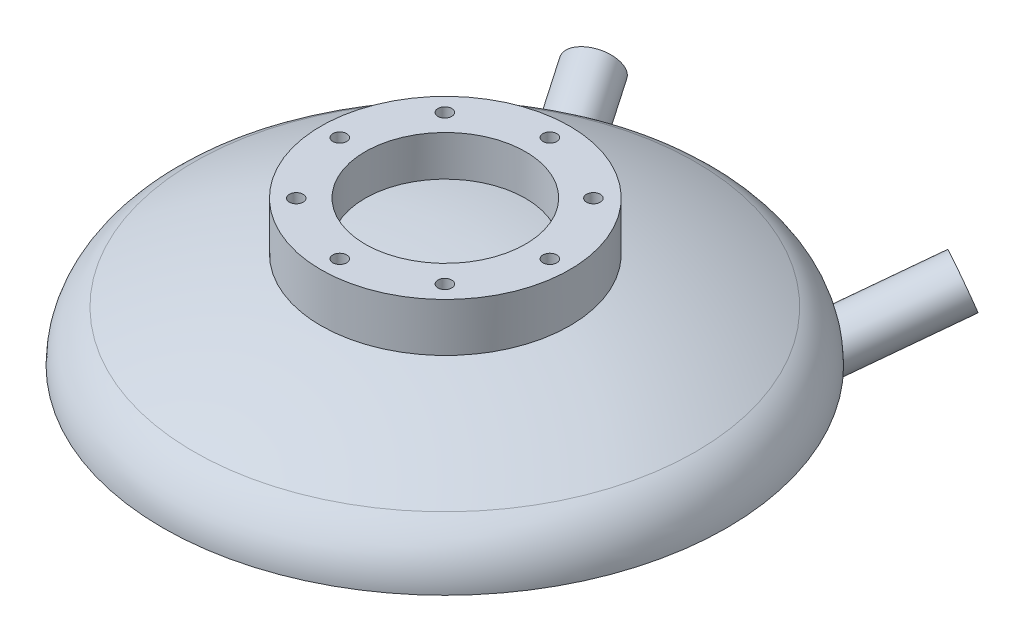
ISO-10303-21;
HEADER;
FILE_DESCRIPTION(('STEP AP214'),'2;1');
FILE_NAME('part.step','',(''),(''),'','','');
FILE_SCHEMA(('AUTOMOTIVE_DESIGN { 1 0 10303 214 1 1 1 1 }'));
ENDSEC;
DATA;
#1=APPLICATION_CONTEXT('core data for automotive mechanical design processes');
#2=APPLICATION_PROTOCOL_DEFINITION('international standard','automotive_design',2000,#1);
#3=PRODUCT_CONTEXT('',#1,'mechanical');
#4=PRODUCT('Part','Part','',(#3));
#5=PRODUCT_RELATED_PRODUCT_CATEGORY('part','',(#4));
#6=PRODUCT_DEFINITION_FORMATION('','',#4);
#7=PRODUCT_DEFINITION_CONTEXT('part definition',#1,'design');
#8=PRODUCT_DEFINITION('design','',#6,#7);
#9=PRODUCT_DEFINITION_SHAPE('','',#8);
#10=(LENGTH_UNIT() NAMED_UNIT(*) SI_UNIT(.MILLI.,.METRE.));
#11=(NAMED_UNIT(*) PLANE_ANGLE_UNIT() SI_UNIT($,.RADIAN.));
#12=(NAMED_UNIT(*) SI_UNIT($,.STERADIAN.) SOLID_ANGLE_UNIT());
#13=UNCERTAINTY_MEASURE_WITH_UNIT(LENGTH_MEASURE(1.E-05),#10,'distance_accuracy_value','');
#14=(GEOMETRIC_REPRESENTATION_CONTEXT(3) GLOBAL_UNCERTAINTY_ASSIGNED_CONTEXT((#13)) GLOBAL_UNIT_ASSIGNED_CONTEXT((#10,
#11,#12)) REPRESENTATION_CONTEXT('',''));
#15=CARTESIAN_POINT('',(0.,0.,0.));
#16=DIRECTION('',(0.,0.,1.));
#17=DIRECTION('',(1.,0.,0.));
#18=AXIS2_PLACEMENT_3D('',#15,#16,#17);
#19=CARTESIAN_POINT('',(26.8700576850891,69.9999999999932,-26.8700576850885));
#20=DIRECTION('',(0.,1.,0.));
#21=DIRECTION('',(0.,0.,1.));
#22=AXIS2_PLACEMENT_3D('',#19,#20,#21);
#23=CONICAL_SURFACE('',#22,2.49999999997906,1.02974425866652);
#24=CARTESIAN_POINT('',(26.8700576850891,68.4978484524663,-26.8700576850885));
#25=VERTEX_POINT('',#24);
#26=VERTEX_LOOP('',#25);
#27=FACE_BOUND('',#26,.T.);
#28=CARTESIAN_POINT('',(26.8700576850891,70.,-26.8700576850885));
#29=DIRECTION('',(0.,1.,0.));
#30=DIRECTION('',(0.,0.,1.));
#31=AXIS2_PLACEMENT_3D('',#28,#29,#30);
#32=CIRCLE('',#31,2.5);
#33=CARTESIAN_POINT('',(26.8700576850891,70.,-24.3700576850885));
#34=VERTEX_POINT('',#33);
#35=EDGE_CURVE('P0_E60',#34,#34,#32,.T.);
#36=ORIENTED_EDGE('',*,*,#35,.T.);
#37=EDGE_LOOP('',(#36));
#38=FACE_BOUND('',#37,.T.);
#39=ADVANCED_FACE('P0_F19',(#27,#38),#23,.F.);
#40=CARTESIAN_POINT('',(3.98119037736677E-13,69.9999999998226,-38.));
#41=DIRECTION('',(0.,1.,0.));
#42=DIRECTION('',(0.,0.,1.));
#43=AXIS2_PLACEMENT_3D('',#40,#41,#42);
#44=CONICAL_SURFACE('',#43,2.49999999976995,1.02974425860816);
#45=CARTESIAN_POINT('',(-1.70530256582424E-10,68.4978484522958,-38.));
#46=VERTEX_POINT('',#45);
#47=VERTEX_LOOP('',#46);
#48=FACE_BOUND('',#47,.T.);
#49=CARTESIAN_POINT('',(3.98028872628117E-13,70.,-38.));
#50=DIRECTION('',(0.,1.,0.));
#51=DIRECTION('',(0.,0.,1.));
#52=AXIS2_PLACEMENT_3D('',#49,#50,#51);
#53=CIRCLE('',#52,2.5);
#54=CARTESIAN_POINT('',(3.98028872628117E-13,70.,-35.5));
#55=VERTEX_POINT('',#54);
#56=EDGE_CURVE('P0_E62',#55,#55,#53,.T.);
#57=ORIENTED_EDGE('',*,*,#56,.T.);
#58=EDGE_LOOP('',(#57));
#59=FACE_BOUND('',#58,.T.);
#60=ADVANCED_FACE('P0_F57',(#48,#59),#44,.F.);
#61=CARTESIAN_POINT('',(-26.8700576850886,69.9999999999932,-26.870057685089));
#62=DIRECTION('',(0.,1.,0.));
#63=DIRECTION('',(0.,0.,1.));
#64=AXIS2_PLACEMENT_3D('',#61,#62,#63);
#65=CONICAL_SURFACE('',#64,2.50000000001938,1.0297442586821);
#66=CARTESIAN_POINT('',(-26.8700576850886,68.4978484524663,-26.870057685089));
#67=VERTEX_POINT('',#66);
#68=VERTEX_LOOP('',#67);
#69=FACE_BOUND('',#68,.T.);
#70=CARTESIAN_POINT('',(-26.8700576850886,70.,-26.870057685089));
#71=DIRECTION('',(0.,1.,0.));
#72=DIRECTION('',(0.,0.,1.));
#73=AXIS2_PLACEMENT_3D('',#70,#71,#72);
#74=CIRCLE('',#73,2.49999999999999);
#75=CARTESIAN_POINT('',(-26.8700576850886,70.,-24.370057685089));
#76=VERTEX_POINT('',#75);
#77=EDGE_CURVE('P0_E65',#76,#76,#74,.T.);
#78=ORIENTED_EDGE('',*,*,#77,.T.);
#79=EDGE_LOOP('',(#78));
#80=FACE_BOUND('',#79,.T.);
#81=ADVANCED_FACE('P0_F139',(#69,#80),#65,.F.);
#82=CARTESIAN_POINT('',(-38.,69.9999999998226,0.));
#83=DIRECTION('',(0.,1.,0.));
#84=DIRECTION('',(0.,0.,1.));
#85=AXIS2_PLACEMENT_3D('',#82,#83,#84);
#86=CONICAL_SURFACE('',#85,2.49999999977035,1.0297442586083);
#87=CARTESIAN_POINT('',(-38.,68.4978484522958,1.70530256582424E-10));
#88=VERTEX_POINT('',#87);
#89=VERTEX_LOOP('',#88);
#90=FACE_BOUND('',#89,.T.);
#91=CARTESIAN_POINT('',(-38.,70.,0.));
#92=DIRECTION('',(0.,1.,0.));
#93=DIRECTION('',(0.,0.,1.));
#94=AXIS2_PLACEMENT_3D('',#91,#92,#93);
#95=CIRCLE('',#94,2.5);
#96=CARTESIAN_POINT('',(-38.,70.,2.5));
#97=VERTEX_POINT('',#96);
#98=EDGE_CURVE('P0_E204',#97,#97,#95,.T.);
#99=ORIENTED_EDGE('',*,*,#98,.T.);
#100=EDGE_LOOP('',(#99));
#101=FACE_BOUND('',#100,.T.);
#102=ADVANCED_FACE('P0_F135',(#90,#101),#86,.F.);
#103=CARTESIAN_POINT('',(-26.870057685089,70.00000000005,26.8700576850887));
#104=DIRECTION('',(0.,1.,0.));
#105=DIRECTION('',(0.,0.,1.));
#106=AXIS2_PLACEMENT_3D('',#103,#104,#105);
#107=CONICAL_SURFACE('',#106,2.50000000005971,1.02974425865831);
#108=CARTESIAN_POINT('',(-26.870057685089,68.4978484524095,26.8700576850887));
#109=VERTEX_POINT('',#108);
#110=VERTEX_LOOP('',#109);
#111=FACE_BOUND('',#110,.T.);
#112=CARTESIAN_POINT('',(-26.870057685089,70.,26.8700576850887));
#113=DIRECTION('',(0.,1.,0.));
#114=DIRECTION('',(0.,0.,1.));
#115=AXIS2_PLACEMENT_3D('',#112,#113,#114);
#116=CIRCLE('',#115,2.5);
#117=CARTESIAN_POINT('',(-26.870057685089,70.,29.3700576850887));
#118=VERTEX_POINT('',#117);
#119=EDGE_CURVE('P0_E201',#118,#118,#116,.T.);
#120=ORIENTED_EDGE('',*,*,#119,.T.);
#121=EDGE_LOOP('',(#120));
#122=FACE_BOUND('',#121,.T.);
#123=ADVANCED_FACE('P0_F131',(#111,#122),#107,.F.);
#124=CARTESIAN_POINT('',(-1.32706345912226E-13,69.9999999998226,38.));
#125=DIRECTION('',(0.,1.,0.));
#126=DIRECTION('',(0.,0.,1.));
#127=AXIS2_PLACEMENT_3D('',#124,#125,#126);
#128=CONICAL_SURFACE('',#127,2.49999999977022,1.02974425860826);
#129=CARTESIAN_POINT('',(1.70530256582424E-10,68.4978484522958,38.));
#130=VERTEX_POINT('',#129);
#131=VERTEX_LOOP('',#130);
#132=FACE_BOUND('',#131,.T.);
#133=CARTESIAN_POINT('',(-1.32676290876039E-13,70.,38.));
#134=DIRECTION('',(0.,1.,0.));
#135=DIRECTION('',(0.,0.,1.));
#136=AXIS2_PLACEMENT_3D('',#133,#134,#135);
#137=CIRCLE('',#136,2.5);
#138=CARTESIAN_POINT('',(-1.32676290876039E-13,70.,40.5));
#139=VERTEX_POINT('',#138);
#140=EDGE_CURVE('P0_E196',#139,#139,#137,.T.);
#141=ORIENTED_EDGE('',*,*,#140,.T.);
#142=EDGE_LOOP('',(#141));
#143=FACE_BOUND('',#142,.T.);
#144=ADVANCED_FACE('P0_F127',(#132,#143),#128,.F.);
#145=CARTESIAN_POINT('',(26.8700576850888,69.9999999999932,26.8700576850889));
#146=DIRECTION('',(0.,1.,0.));
#147=DIRECTION('',(0.,0.,1.));
#148=AXIS2_PLACEMENT_3D('',#145,#146,#147);
#149=CONICAL_SURFACE('',#148,2.50000000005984,1.02974425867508);
#150=CARTESIAN_POINT('',(26.8700576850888,68.4978484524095,26.8700576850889));
#151=VERTEX_POINT('',#150);
#152=VERTEX_LOOP('',#151);
#153=FACE_BOUND('',#152,.T.);
#154=CARTESIAN_POINT('',(26.8700576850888,70.,26.8700576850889));
#155=DIRECTION('',(0.,1.,0.));
#156=DIRECTION('',(0.,0.,1.));
#157=AXIS2_PLACEMENT_3D('',#154,#155,#156);
#158=CIRCLE('',#157,2.5);
#159=CARTESIAN_POINT('',(26.8700576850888,70.,29.3700576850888));
#160=VERTEX_POINT('',#159);
#161=EDGE_CURVE('P0_E191',#160,#160,#158,.T.);
#162=ORIENTED_EDGE('',*,*,#161,.T.);
#163=EDGE_LOOP('',(#162));
#164=FACE_BOUND('',#163,.T.);
#165=ADVANCED_FACE('P0_F124',(#153,#164),#149,.F.);
#166=CARTESIAN_POINT('',(38.,69.9999999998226,0.));
#167=DIRECTION('',(0.,1.,0.));
#168=DIRECTION('',(0.,0.,1.));
#169=AXIS2_PLACEMENT_3D('',#166,#167,#168);
#170=CONICAL_SURFACE('',#169,2.49999999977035,1.0297442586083);
#171=CARTESIAN_POINT('',(38.,68.4978484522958,-1.70530256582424E-10));
#172=VERTEX_POINT('',#171);
#173=VERTEX_LOOP('',#172);
#174=FACE_BOUND('',#173,.T.);
#175=CARTESIAN_POINT('',(38.,70.,0.));
#176=DIRECTION('',(0.,1.,0.));
#177=DIRECTION('',(0.,0.,1.));
#178=AXIS2_PLACEMENT_3D('',#175,#176,#177);
#179=CIRCLE('',#178,2.5);
#180=CARTESIAN_POINT('',(38.,70.,2.5));
#181=VERTEX_POINT('',#180);
#182=EDGE_CURVE('P0_E187',#181,#181,#179,.T.);
#183=ORIENTED_EDGE('',*,*,#182,.T.);
#184=EDGE_LOOP('',(#183));
#185=FACE_BOUND('',#184,.T.);
#186=ADVANCED_FACE('P0_F120',(#174,#185),#170,.F.);
#187=CARTESIAN_POINT('',(26.8700576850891,83.,-26.8700576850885));
#188=DIRECTION('',(0.,1.,0.));
#189=DIRECTION('',(0.,0.,1.));
#190=AXIS2_PLACEMENT_3D('',#187,#188,#189);
#191=CYLINDRICAL_SURFACE('',#190,2.5);
#192=CARTESIAN_POINT('',(26.8700576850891,83.,-26.8700576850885));
#193=DIRECTION('',(0.,1.,0.));
#194=DIRECTION('',(0.,0.,1.));
#195=AXIS2_PLACEMENT_3D('',#192,#193,#194);
#196=CIRCLE('',#195,2.5);
#197=CARTESIAN_POINT('',(26.8700576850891,83.,-24.3700576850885));
#198=VERTEX_POINT('',#197);
#199=EDGE_CURVE('P0_E24',#198,#198,#196,.F.);
#200=ORIENTED_EDGE('',*,*,#199,.F.);
#201=EDGE_LOOP('',(#200));
#202=FACE_BOUND('',#201,.T.);
#203=ORIENTED_EDGE('',*,*,#35,.F.);
#204=EDGE_LOOP('',(#203));
#205=FACE_BOUND('',#204,.T.);
#206=ADVANCED_FACE('P0_F116',(#202,#205),#191,.F.);
#207=CARTESIAN_POINT('',(3.98028872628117E-13,83.,-38.));
#208=DIRECTION('',(0.,1.,0.));
#209=DIRECTION('',(0.,0.,1.));
#210=AXIS2_PLACEMENT_3D('',#207,#208,#209);
#211=CYLINDRICAL_SURFACE('',#210,2.5);
#212=CARTESIAN_POINT('',(3.98028872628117E-13,83.,-38.));
#213=DIRECTION('',(0.,1.,0.));
#214=DIRECTION('',(0.,0.,1.));
#215=AXIS2_PLACEMENT_3D('',#212,#213,#214);
#216=CIRCLE('',#215,2.5);
#217=CARTESIAN_POINT('',(3.98028872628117E-13,83.,-35.5));
#218=VERTEX_POINT('',#217);
#219=EDGE_CURVE('P0_E182',#218,#218,#216,.F.);
#220=ORIENTED_EDGE('',*,*,#219,.F.);
#221=EDGE_LOOP('',(#220));
#222=FACE_BOUND('',#221,.T.);
#223=ORIENTED_EDGE('',*,*,#56,.F.);
#224=EDGE_LOOP('',(#223));
#225=FACE_BOUND('',#224,.T.);
#226=ADVANCED_FACE('P0_F112',(#222,#225),#211,.F.);
#227=CARTESIAN_POINT('',(-26.8700576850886,83.,-26.870057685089));
#228=DIRECTION('',(0.,1.,0.));
#229=DIRECTION('',(0.,0.,1.));
#230=AXIS2_PLACEMENT_3D('',#227,#228,#229);
#231=CYLINDRICAL_SURFACE('',#230,2.49999999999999);
#232=CARTESIAN_POINT('',(-26.8700576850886,83.,-26.870057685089));
#233=DIRECTION('',(0.,1.,0.));
#234=DIRECTION('',(0.,0.,1.));
#235=AXIS2_PLACEMENT_3D('',#232,#233,#234);
#236=CIRCLE('',#235,2.49999999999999);
#237=CARTESIAN_POINT('',(-26.8700576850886,83.,-24.370057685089));
#238=VERTEX_POINT('',#237);
#239=EDGE_CURVE('P0_E180',#238,#238,#236,.F.);
#240=ORIENTED_EDGE('',*,*,#239,.F.);
#241=EDGE_LOOP('',(#240));
#242=FACE_BOUND('',#241,.T.);
#243=ORIENTED_EDGE('',*,*,#77,.F.);
#244=EDGE_LOOP('',(#243));
#245=FACE_BOUND('',#244,.T.);
#246=ADVANCED_FACE('P0_F108',(#242,#245),#231,.F.);
#247=CARTESIAN_POINT('',(-38.,83.,0.));
#248=DIRECTION('',(0.,1.,0.));
#249=DIRECTION('',(0.,0.,1.));
#250=AXIS2_PLACEMENT_3D('',#247,#248,#249);
#251=CYLINDRICAL_SURFACE('',#250,2.5);
#252=CARTESIAN_POINT('',(-38.,83.,0.));
#253=DIRECTION('',(0.,1.,0.));
#254=DIRECTION('',(0.,0.,1.));
#255=AXIS2_PLACEMENT_3D('',#252,#253,#254);
#256=CIRCLE('',#255,2.5);
#257=CARTESIAN_POINT('',(-38.,83.,2.5));
#258=VERTEX_POINT('',#257);
#259=EDGE_CURVE('P0_E177',#258,#258,#256,.F.);
#260=ORIENTED_EDGE('',*,*,#259,.F.);
#261=EDGE_LOOP('',(#260));
#262=FACE_BOUND('',#261,.T.);
#263=ORIENTED_EDGE('',*,*,#98,.F.);
#264=EDGE_LOOP('',(#263));
#265=FACE_BOUND('',#264,.T.);
#266=ADVANCED_FACE('P0_F104',(#262,#265),#251,.F.);
#267=CARTESIAN_POINT('',(-26.870057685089,83.,26.8700576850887));
#268=DIRECTION('',(0.,1.,0.));
#269=DIRECTION('',(0.,0.,1.));
#270=AXIS2_PLACEMENT_3D('',#267,#268,#269);
#271=CYLINDRICAL_SURFACE('',#270,2.5);
#272=CARTESIAN_POINT('',(-26.870057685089,83.,26.8700576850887));
#273=DIRECTION('',(0.,1.,0.));
#274=DIRECTION('',(0.,0.,1.));
#275=AXIS2_PLACEMENT_3D('',#272,#273,#274);
#276=CIRCLE('',#275,2.5);
#277=CARTESIAN_POINT('',(-26.870057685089,83.,29.3700576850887));
#278=VERTEX_POINT('',#277);
#279=EDGE_CURVE('P0_E174',#278,#278,#276,.F.);
#280=ORIENTED_EDGE('',*,*,#279,.F.);
#281=EDGE_LOOP('',(#280));
#282=FACE_BOUND('',#281,.T.);
#283=ORIENTED_EDGE('',*,*,#119,.F.);
#284=EDGE_LOOP('',(#283));
#285=FACE_BOUND('',#284,.T.);
#286=ADVANCED_FACE('P0_F100',(#282,#285),#271,.F.);
#287=CARTESIAN_POINT('',(-1.32676290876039E-13,83.,38.));
#288=DIRECTION('',(0.,1.,0.));
#289=DIRECTION('',(0.,0.,1.));
#290=AXIS2_PLACEMENT_3D('',#287,#288,#289);
#291=CYLINDRICAL_SURFACE('',#290,2.5);
#292=CARTESIAN_POINT('',(-1.32676290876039E-13,83.,38.));
#293=DIRECTION('',(0.,1.,0.));
#294=DIRECTION('',(0.,0.,1.));
#295=AXIS2_PLACEMENT_3D('',#292,#293,#294);
#296=CIRCLE('',#295,2.5);
#297=CARTESIAN_POINT('',(-1.32676290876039E-13,83.,40.5));
#298=VERTEX_POINT('',#297);
#299=EDGE_CURVE('P0_E171',#298,#298,#296,.F.);
#300=ORIENTED_EDGE('',*,*,#299,.F.);
#301=EDGE_LOOP('',(#300));
#302=FACE_BOUND('',#301,.T.);
#303=ORIENTED_EDGE('',*,*,#140,.F.);
#304=EDGE_LOOP('',(#303));
#305=FACE_BOUND('',#304,.T.);
#306=ADVANCED_FACE('P0_F96',(#302,#305),#291,.F.);
#307=CARTESIAN_POINT('',(26.8700576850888,83.,26.8700576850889));
#308=DIRECTION('',(0.,1.,0.));
#309=DIRECTION('',(0.,0.,1.));
#310=AXIS2_PLACEMENT_3D('',#307,#308,#309);
#311=CYLINDRICAL_SURFACE('',#310,2.5);
#312=CARTESIAN_POINT('',(26.8700576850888,83.,26.8700576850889));
#313=DIRECTION('',(0.,1.,0.));
#314=DIRECTION('',(0.,0.,1.));
#315=AXIS2_PLACEMENT_3D('',#312,#313,#314);
#316=CIRCLE('',#315,2.5);
#317=CARTESIAN_POINT('',(26.8700576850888,83.,29.3700576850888));
#318=VERTEX_POINT('',#317);
#319=EDGE_CURVE('P0_E168',#318,#318,#316,.F.);
#320=ORIENTED_EDGE('',*,*,#319,.F.);
#321=EDGE_LOOP('',(#320));
#322=FACE_BOUND('',#321,.T.);
#323=ORIENTED_EDGE('',*,*,#161,.F.);
#324=EDGE_LOOP('',(#323));
#325=FACE_BOUND('',#324,.T.);
#326=ADVANCED_FACE('P0_F92',(#322,#325),#311,.F.);
#327=CARTESIAN_POINT('',(38.,83.,0.));
#328=DIRECTION('',(0.,1.,0.));
#329=DIRECTION('',(0.,0.,1.));
#330=AXIS2_PLACEMENT_3D('',#327,#328,#329);
#331=CYLINDRICAL_SURFACE('',#330,2.5);
#332=CARTESIAN_POINT('',(38.,83.,0.));
#333=DIRECTION('',(0.,1.,0.));
#334=DIRECTION('',(0.,0.,1.));
#335=AXIS2_PLACEMENT_3D('',#332,#333,#334);
#336=CIRCLE('',#335,2.5);
#337=CARTESIAN_POINT('',(38.,83.,2.5));
#338=VERTEX_POINT('',#337);
#339=EDGE_CURVE('P0_E163',#338,#338,#336,.F.);
#340=ORIENTED_EDGE('',*,*,#339,.F.);
#341=EDGE_LOOP('',(#340));
#342=FACE_BOUND('',#341,.T.);
#343=ORIENTED_EDGE('',*,*,#182,.F.);
#344=EDGE_LOOP('',(#343));
#345=FACE_BOUND('',#344,.T.);
#346=ADVANCED_FACE('P0_F88',(#342,#345),#331,.F.);
#347=CARTESIAN_POINT('',(0.,83.,-0.190000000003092));
#348=DIRECTION('',(0.,1.,0.));
#349=DIRECTION('',(0.,0.,1.));
#350=AXIS2_PLACEMENT_3D('',#347,#348,#349);
#351=PLANE('',#350);
#352=CARTESIAN_POINT('',(0.,83.,-0.190000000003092));
#353=DIRECTION('',(0.,1.,0.));
#354=DIRECTION('',(0.,0.,1.));
#355=AXIS2_PLACEMENT_3D('',#352,#353,#354);
#356=CIRCLE('',#355,45.);
#357=CARTESIAN_POINT('',(0.,83.,44.8099999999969));
#358=VERTEX_POINT('',#357);
#359=EDGE_CURVE('P0_E159',#358,#358,#356,.F.);
#360=ORIENTED_EDGE('',*,*,#359,.F.);
#361=EDGE_LOOP('',(#360));
#362=FACE_BOUND('',#361,.T.);
#363=CARTESIAN_POINT('',(0.,83.,-0.190000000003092));
#364=DIRECTION('',(0.,1.,0.));
#365=DIRECTION('',(0.,0.,1.));
#366=AXIS2_PLACEMENT_3D('',#363,#364,#365);
#367=CIRCLE('',#366,29.);
#368=CARTESIAN_POINT('',(0.,83.,28.8099999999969));
#369=VERTEX_POINT('',#368);
#370=EDGE_CURVE('P0_E157',#369,#369,#367,.F.);
#371=ORIENTED_EDGE('',*,*,#370,.T.);
#372=EDGE_LOOP('',(#371));
#373=FACE_BOUND('',#372,.T.);
#374=ORIENTED_EDGE('',*,*,#339,.T.);
#375=EDGE_LOOP('',(#374));
#376=FACE_BOUND('',#375,.T.);
#377=ORIENTED_EDGE('',*,*,#319,.T.);
#378=EDGE_LOOP('',(#377));
#379=FACE_BOUND('',#378,.T.);
#380=ORIENTED_EDGE('',*,*,#299,.T.);
#381=EDGE_LOOP('',(#380));
#382=FACE_BOUND('',#381,.T.);
#383=ORIENTED_EDGE('',*,*,#279,.T.);
#384=EDGE_LOOP('',(#383));
#385=FACE_BOUND('',#384,.T.);
#386=ORIENTED_EDGE('',*,*,#259,.T.);
#387=EDGE_LOOP('',(#386));
#388=FACE_BOUND('',#387,.T.);
#389=ORIENTED_EDGE('',*,*,#239,.T.);
#390=EDGE_LOOP('',(#389));
#391=FACE_BOUND('',#390,.T.);
#392=ORIENTED_EDGE('',*,*,#219,.T.);
#393=EDGE_LOOP('',(#392));
#394=FACE_BOUND('',#393,.T.);
#395=ORIENTED_EDGE('',*,*,#199,.T.);
#396=EDGE_LOOP('',(#395));
#397=FACE_BOUND('',#396,.T.);
#398=ADVANCED_FACE('P0_F84',(#362,#373,#376,#379,#382,#385,#388,#391,#394,#397),#351,.T.);
#399=CARTESIAN_POINT('',(0.,-333.501000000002,-0.190000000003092));
#400=DIRECTION('',(0.,1.,0.));
#401=DIRECTION('',(0.,0.,1.));
#402=AXIS2_PLACEMENT_3D('',#399,#400,#401);
#403=CYLINDRICAL_SURFACE('',#402,45.);
#404=CARTESIAN_POINT('',(0.,65.4671645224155,44.8099999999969));
#405=CARTESIAN_POINT('',(1.26333209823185,65.4671645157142,44.8099930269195));
#406=CARTESIAN_POINT('',(2.52689312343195,65.4671131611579,44.7567552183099));
#407=CARTESIAN_POINT('',(5.0455543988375,65.466908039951,44.5441125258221));
#408=CARTESIAN_POINT('',(6.30065017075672,65.4667542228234,44.38465531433));
#409=CARTESIAN_POINT('',(8.79544656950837,65.4663448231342,43.9602446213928));
#410=CARTESIAN_POINT('',(10.0351121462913,65.4660890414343,43.6950847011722));
#411=CARTESIAN_POINT('',(12.4875001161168,65.4654775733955,43.061198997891));
#412=CARTESIAN_POINT('',(13.7002258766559,65.4651218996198,42.6924862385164));
#413=CARTESIAN_POINT('',(16.0893269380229,65.4643134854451,41.8544384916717));
#414=CARTESIAN_POINT('',(17.2657300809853,65.4638608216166,41.3851828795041));
#415=CARTESIAN_POINT('',(19.5748475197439,65.4628614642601,40.3491997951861));
#416=CARTESIAN_POINT('',(20.7075604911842,65.4623147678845,39.7824693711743));
#417=CARTESIAN_POINT('',(22.9206657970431,65.4611315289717,38.5558758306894));
#418=CARTESIAN_POINT('',(24.0010832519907,65.4604950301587,37.8960580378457));
#419=CARTESIAN_POINT('',(26.1024998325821,65.4591365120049,36.4877765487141));
#420=CARTESIAN_POINT('',(27.1234994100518,65.4584144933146,35.7393135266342));
#421=CARTESIAN_POINT('',(29.099028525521,65.4568899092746,34.1589003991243));
#422=CARTESIAN_POINT('',(30.0535449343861,65.4560873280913,33.3269338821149));
#423=CARTESIAN_POINT('',(31.8891031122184,65.454407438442,31.5855492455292));
#424=CARTESIAN_POINT('',(32.770144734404,65.4535301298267,30.6761309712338));
#425=CARTESIAN_POINT('',(34.4525601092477,65.4517069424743,28.7862282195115));
#426=CARTESIAN_POINT('',(35.2539270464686,65.4507610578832,27.8057376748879));
#427=CARTESIAN_POINT('',(36.7712094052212,65.4488075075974,25.7807307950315));
#428=CARTESIAN_POINT('',(37.4871248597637,65.4477998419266,24.7362144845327));
#429=CARTESIAN_POINT('',(38.8283895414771,65.4457299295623,22.5906221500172));
#430=CARTESIAN_POINT('',(39.4537421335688,65.4446676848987,21.4895482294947));
#431=CARTESIAN_POINT('',(40.6094668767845,65.4424961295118,19.2386329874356));
#432=CARTESIAN_POINT('',(41.1398390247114,65.4413868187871,18.0887916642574));
#433=CARTESIAN_POINT('',(42.1018270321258,65.439129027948,15.7485289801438));
#434=CARTESIAN_POINT('',(42.5334439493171,65.4379805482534,14.5581080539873));
#435=CARTESIAN_POINT('',(43.2948602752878,65.4356525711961,12.1451375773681));
#436=CARTESIAN_POINT('',(43.6246596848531,65.4344730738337,10.9225880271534));
#437=CARTESIAN_POINT('',(44.1800979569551,65.4320914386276,8.45404466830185));
#438=CARTESIAN_POINT('',(44.4057362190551,65.4308893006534,7.20805072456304));
#439=CARTESIAN_POINT('',(44.7512452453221,65.4284709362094,4.70148369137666));
#440=CARTESIAN_POINT('',(44.8711160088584,65.4272547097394,3.44091060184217));
#441=CARTESIAN_POINT('',(45.0042378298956,65.4248168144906,0.914147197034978));
#442=CARTESIAN_POINT('',(45.0174888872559,65.4235951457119,-0.352043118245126));
#443=CARTESIAN_POINT('',(44.9372770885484,65.4211550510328,-2.88103911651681));
#444=CARTESIAN_POINT('',(44.8438142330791,65.4199366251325,-4.14384479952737));
#445=CARTESIAN_POINT('',(44.5508398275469,65.4175116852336,-6.6570872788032));
#446=CARTESIAN_POINT('',(44.3513288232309,65.4163051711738,-7.90752413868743));
#447=CARTESIAN_POINT('',(43.8476768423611,65.4139126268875,-10.3871458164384));
#448=CARTESIAN_POINT('',(43.5435358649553,65.4127265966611,-11.6163306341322));
#449=CARTESIAN_POINT('',(42.832782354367,65.4103834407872,-14.0447225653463));
#450=CARTESIAN_POINT('',(42.426168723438,65.4092263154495,-15.2439293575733));
#451=CARTESIAN_POINT('',(41.5133623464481,65.406949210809,-17.6038257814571));
#452=CARTESIAN_POINT('',(41.007169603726,65.4058292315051,-18.7645154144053));
#453=CARTESIAN_POINT('',(39.8987829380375,65.4036343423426,-21.0391683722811));
#454=CARTESIAN_POINT('',(39.2965854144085,65.4025594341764,-22.1531299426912));
#455=CARTESIAN_POINT('',(38.000484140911,65.4004623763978,-24.3263607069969));
#456=CARTESIAN_POINT('',(37.3065803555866,65.3994402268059,-25.3856298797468));
#457=CARTESIAN_POINT('',(35.8320635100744,65.3974560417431,-27.4418559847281));
#458=CARTESIAN_POINT('',(35.0514578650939,65.3964940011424,-28.438818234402));
#459=CARTESIAN_POINT('',(33.4090398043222,65.3946367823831,-30.3634400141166));
#460=CARTESIAN_POINT('',(32.5472275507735,65.393741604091,-31.2910996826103));
#461=CARTESIAN_POINT('',(30.7486988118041,65.3920246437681,-33.0703484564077));
#462=CARTESIAN_POINT('',(29.8119971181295,65.3912028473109,-33.9219525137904));
#463=CARTESIAN_POINT('',(27.8701906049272,65.3896382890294,-35.5432500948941));
#464=CARTESIAN_POINT('',(26.8650852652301,65.3888955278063,-36.3129429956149));
#465=CARTESIAN_POINT('',(24.7931168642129,65.3874939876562,-37.7652941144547));
#466=CARTESIAN_POINT('',(23.7262240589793,65.3868352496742,-38.4479098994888));
#467=CARTESIAN_POINT('',(21.5387460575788,65.3856068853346,-39.7207941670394));
#468=CARTESIAN_POINT('',(20.4181624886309,65.3850372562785,-40.3110654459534));
#469=CARTESIAN_POINT('',(18.1303455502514,65.383990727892,-41.3955140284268));
#470=CARTESIAN_POINT('',(16.9630761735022,65.3835139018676,-41.8896153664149));
#471=CARTESIAN_POINT('',(14.5908704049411,65.3826568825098,-42.7776817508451));
#472=CARTESIAN_POINT('',(13.3859292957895,65.3822767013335,-43.1716341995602));
#473=CARTESIAN_POINT('',(10.9495388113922,65.381616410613,-43.8558412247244));
#474=CARTESIAN_POINT('',(9.71814598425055,65.3813361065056,-44.1462974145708));
#475=CARTESIAN_POINT('',(7.23577075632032,65.3808766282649,-44.6224162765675));
#476=CARTESIAN_POINT('',(5.98479830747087,65.3806974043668,-44.8081305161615));
#477=CARTESIAN_POINT('',(3.94323813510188,65.3804892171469,-45.0238568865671));
#478=CARTESIAN_POINT('',(3.15592006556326,65.3804291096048,-45.0861411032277));
#479=CARTESIAN_POINT('',(1.57909780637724,65.380348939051,-45.1692148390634));
#480=CARTESIAN_POINT('',(0.789593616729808,65.3803288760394,-45.1900043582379));
#481=CARTESIAN_POINT('',(-1.26333209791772,65.3803288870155,-45.1899930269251));
#482=CARTESIAN_POINT('',(-2.52689312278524,65.3803802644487,-45.136755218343));
#483=CARTESIAN_POINT('',(-5.04555439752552,65.3805854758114,-44.9241125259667));
#484=CARTESIAN_POINT('',(-6.30065016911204,65.3807393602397,-44.7646553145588));
#485=CARTESIAN_POINT('',(-8.79544656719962,65.3811489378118,-44.340244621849));
#486=CARTESIAN_POINT('',(-10.0351121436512,65.3814048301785,-44.0750847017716));
#487=CARTESIAN_POINT('',(-12.4875001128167,65.382016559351,-43.4411989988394));
#488=CARTESIAN_POINT('',(-13.7002258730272,65.3823723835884,-43.0724862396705));
#489=CARTESIAN_POINT('',(-16.0893269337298,65.3831811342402,-42.2344384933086));
#490=CARTESIAN_POINT('',(-17.2657300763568,65.3836339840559,-41.7651828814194));
#491=CARTESIAN_POINT('',(-19.5748475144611,65.3846337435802,-40.7291997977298));
#492=CARTESIAN_POINT('',(-20.7075604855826,65.3851806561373,-40.162469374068));
#493=CARTESIAN_POINT('',(-22.9206657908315,65.3863643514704,-38.9358758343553));
#494=CARTESIAN_POINT('',(-24.001083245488,65.3870010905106,-38.2760580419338));
#495=CARTESIAN_POINT('',(-26.1024998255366,65.3883601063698,-36.8677765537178));
#496=CARTESIAN_POINT('',(-27.1234994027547,65.3890823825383,-36.1193135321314));
#497=CARTESIAN_POINT('',(-29.0990285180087,65.3906074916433,-34.5389004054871));
#498=CARTESIAN_POINT('',(-30.0535449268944,65.3914103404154,-33.7069338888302));
#499=CARTESIAN_POINT('',(-31.8891031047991,65.3930907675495,-31.9655492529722));
#500=CARTESIAN_POINT('',(-32.7701447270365,65.3939683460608,-31.0561309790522));
#501=CARTESIAN_POINT('',(-34.4525601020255,65.3957920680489,-29.1662282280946));
#502=CARTESIAN_POINT('',(-35.2539270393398,65.3967382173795,-28.1857376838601));
#503=CARTESIAN_POINT('',(-36.7712093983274,65.3986922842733,-26.1607308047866));
#504=CARTESIAN_POINT('',(-37.4871248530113,65.3997002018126,-25.1162144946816));
#505=CARTESIAN_POINT('',(-38.8283895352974,65.4017705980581,-22.9706221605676));
#506=CARTESIAN_POINT('',(-39.4537421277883,65.4028330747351,-21.869548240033));
#507=CARTESIAN_POINT('',(-40.6094668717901,65.4050050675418,-19.618632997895));
#508=CARTESIAN_POINT('',(-41.1398390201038,65.406114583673,-18.46879167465));
#509=CARTESIAN_POINT('',(-42.1018270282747,65.4083727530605,-16.1285289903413));
#510=CARTESIAN_POINT('',(-42.5334439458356,65.4095214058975,-14.9381080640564));
#511=CARTESIAN_POINT('',(-43.2948602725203,65.4118496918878,-12.5251375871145));
#512=CARTESIAN_POINT('',(-43.62465968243,65.4130293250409,-11.3025880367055));
#513=CARTESIAN_POINT('',(-44.1800979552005,65.4154111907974,-8.83404467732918));
#514=CARTESIAN_POINT('',(-44.4057362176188,65.4166134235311,-7.58805073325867));
#515=CARTESIAN_POINT('',(-44.7512452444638,65.4190319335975,-5.08148369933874));
#516=CARTESIAN_POINT('',(-44.8711160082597,65.4202482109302,-3.82091060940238));
#517=CARTESIAN_POINT('',(-45.004237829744,65.4226861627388,-1.29414720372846));
#518=CARTESIAN_POINT('',(-45.017488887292,65.4239078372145,-0.0279568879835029));
#519=CARTESIAN_POINT('',(-44.9372770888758,65.4263478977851,2.50103911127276));
#520=CARTESIAN_POINT('',(-44.8438142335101,65.4275662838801,3.76384479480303));
#521=CARTESIAN_POINT('',(-44.5508398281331,65.4299910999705,6.27708727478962));
#522=CARTESIAN_POINT('',(-44.3513288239,65.4311975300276,7.52752413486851));
#523=CARTESIAN_POINT('',(-43.8476768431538,65.4335898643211,10.0071458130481));
#524=CARTESIAN_POINT('',(-43.5435358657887,65.4347757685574,11.2363306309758));
#525=CARTESIAN_POINT('',(-42.8327823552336,65.4371186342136,13.6647225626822));
#526=CARTESIAN_POINT('',(-42.4261687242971,65.4382755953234,14.8639293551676));
#527=CARTESIAN_POINT('',(-41.5133623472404,65.4405523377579,17.2238257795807));
#528=CARTESIAN_POINT('',(-41.0071696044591,65.441672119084,18.3845154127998));
#529=CARTESIAN_POINT('',(-39.8987829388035,65.4438665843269,20.659168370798));
#530=CARTESIAN_POINT('',(-39.2965854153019,65.4449412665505,21.7731299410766));
#531=CARTESIAN_POINT('',(-38.0004841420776,65.4470378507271,23.946360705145));
#532=CARTESIAN_POINT('',(-37.3065803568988,65.4480597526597,25.0056298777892));
#533=CARTESIAN_POINT('',(-35.8320635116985,65.450043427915,27.0618559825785));
#534=CARTESIAN_POINT('',(-35.0514578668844,65.4510052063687,28.0588182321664));
#535=CARTESIAN_POINT('',(-33.4090398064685,65.452861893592,29.9834400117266));
#536=CARTESIAN_POINT('',(-32.5472275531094,65.4537568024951,30.911099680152));
#537=CARTESIAN_POINT('',(-30.7486988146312,65.4554732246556,32.690348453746));
#538=CARTESIAN_POINT('',(-29.8119971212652,65.4562947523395,33.5419525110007));
#539=CARTESIAN_POINT('',(-27.8701906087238,65.4578587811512,35.1632500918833));
#540=CARTESIAN_POINT('',(-26.865085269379,65.458601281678,35.9329429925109));
#541=CARTESIAN_POINT('',(-24.7931168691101,65.4600023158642,37.3852941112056));
#542=CARTESIAN_POINT('',(-23.7262240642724,65.4606608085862,38.0679098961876));
#543=CARTESIAN_POINT('',(-21.5387460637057,65.4618887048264,39.3407941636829));
#544=CARTESIAN_POINT('',(-20.4181624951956,65.4624581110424,39.9310654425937));
#545=CARTESIAN_POINT('',(-18.130345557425,65.4635042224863,41.0155140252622));
#546=CARTESIAN_POINT('',(-16.9630761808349,65.4639808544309,41.5096153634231));
#547=CARTESIAN_POINT('',(-14.5908704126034,65.4648375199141,42.397681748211));
#548=CARTESIAN_POINT('',(-13.3859293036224,65.4652175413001,42.7916341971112));
#549=CARTESIAN_POINT('',(-10.9495388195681,65.4658775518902,43.4758412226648));
#550=CARTESIAN_POINT('',(-9.71814599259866,65.4661577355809,43.7662974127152));
#551=CARTESIAN_POINT('',(-7.23577076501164,65.4666170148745,44.2424162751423));
#552=CARTESIAN_POINT('',(-5.98479831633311,65.4667961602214,44.4281305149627));
#553=CARTESIAN_POINT('',(-3.94323814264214,65.4670042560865,44.6438568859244));
#554=CARTESIAN_POINT('',(-3.15592007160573,65.467064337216,44.7061411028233));
#555=CARTESIAN_POINT('',(-1.5790978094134,65.4671444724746,44.7892148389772));
#556=CARTESIAN_POINT('',(-0.789593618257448,65.4671645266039,44.8100043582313));
#557=CARTESIAN_POINT('',(0.,65.4671645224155,44.8099999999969));
#558=B_SPLINE_CURVE_WITH_KNOTS('',3,(#404,#405,#406,#407,#408,#409,#410,#411,#412,#413,#414,
#415,#416,#417,#418,#419,#420,#421,#422,#423,#424,#425,#426,#427,#428,#429,#430,#431,#432,#433,
#434,#435,#436,#437,#438,#439,#440,#441,#442,#443,#444,#445,#446,#447,#448,#449,#450,#451,#452,
#453,#454,#455,#456,#457,#458,#459,#460,#461,#462,#463,#464,#465,#466,#467,#468,#469,#470,#471,
#472,#473,#474,#475,#476,#477,#478,#479,#480,#481,#482,#483,#484,#485,#486,#487,#488,#489,#490,
#491,#492,#493,#494,#495,#496,#497,#498,#499,#500,#501,#502,#503,#504,#505,#506,#507,#508,#509,
#510,#511,#512,#513,#514,#515,#516,#517,#518,#519,#520,#521,#522,#523,#524,#525,#526,#527,#528,
#529,#530,#531,#532,#533,#534,#535,#536,#537,#538,#539,#540,#541,#542,#543,#544,#545,#546,#547,
#548,#549,#550,#551,#552,#553,#554,#555,#556,#557),.UNSPECIFIED.,.T.,.F.,(4,2,2,2,2,2,2,2,2,2,2,
2,2,2,2,2,2,2,2,2,2,2,2,2,2,2,2,2,2,2,2,2,2,2,2,2,2,2,2,2,2,2,2,2,2,2,2,2,2,2,2,2,2,2,2,2,2,2,2,
2,2,2,2,2,2,2,2,2,2,2,2,2,2,2,2,2,4),(0.,3.78927346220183,7.58041504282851,11.3789973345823,
15.17710209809,18.972219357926,22.7674515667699,26.5608422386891,30.3542040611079,
34.1483128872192,37.9424292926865,41.7368699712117,45.5313091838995,49.3256073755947,
53.119905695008,56.9141633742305,60.7084210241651,64.5027005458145,68.2969800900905,
72.0912596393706,75.8855391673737,79.6797991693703,83.4740592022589,87.2683598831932,
91.0626604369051,94.8571033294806,98.6515476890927,102.445667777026,106.239780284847,
110.033145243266,113.82653905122,117.621774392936,121.416894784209,125.215000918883,
129.013584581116,132.804727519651,136.594002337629,138.962331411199,141.330660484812,
145.119933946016,148.911075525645,152.709657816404,156.507762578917,160.302879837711,
164.098112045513,167.891502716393,171.684864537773,175.478973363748,179.273089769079,
183.067530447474,186.861969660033,190.656267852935,194.450566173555,198.244823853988,
202.039081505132,205.833361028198,209.62764057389,213.421920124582,217.216199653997,
221.010459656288,224.804719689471,228.599020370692,232.39332092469,236.187763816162,
239.98220817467,243.776328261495,247.570440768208,251.363805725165,255.157199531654,
258.952434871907,262.747555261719,266.54566139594,270.344245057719,274.135387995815,
277.924662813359,280.292991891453,282.661320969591),.UNSPECIFIED.);
#559=CARTESIAN_POINT('',(0.,65.4671645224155,44.8099999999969));
#560=VERTEX_POINT('',#559);
#561=EDGE_CURVE('P0_E30',#560,#560,#558,.T.);
#562=ORIENTED_EDGE('',*,*,#561,.T.);
#563=EDGE_LOOP('',(#562));
#564=FACE_BOUND('',#563,.T.);
#565=ORIENTED_EDGE('',*,*,#359,.T.);
#566=EDGE_LOOP('',(#565));
#567=FACE_BOUND('',#566,.T.);
#568=ADVANCED_FACE('P0_F79',(#564,#567),#403,.T.);
#569=CARTESIAN_POINT('',(0.,-333.501000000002,-0.190000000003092));
#570=DIRECTION('',(0.,1.,0.));
#571=DIRECTION('',(0.,0.,1.));
#572=AXIS2_PLACEMENT_3D('',#569,#570,#571);
#573=CYLINDRICAL_SURFACE('',#572,29.);
#574=ORIENTED_EDGE('',*,*,#370,.F.);
#575=EDGE_LOOP('',(#574));
#576=FACE_BOUND('',#575,.T.);
#577=CARTESIAN_POINT('',(-1.22012043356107E-11,68.3798236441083,-29.1900000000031));
#578=CARTESIAN_POINT('',(0.407122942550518,68.3798236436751,-29.1900003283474));
#579=CARTESIAN_POINT('',(0.814234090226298,68.3798317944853,-29.1814257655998));
#580=CARTESIAN_POINT('',(1.62774008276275,68.37986438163,-29.1471442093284));
#581=CARTESIAN_POINT('',(2.03413492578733,68.3798888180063,-29.1214371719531));
#582=CARTESIAN_POINT('',(2.84563836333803,68.3799539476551,-29.0529207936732));
#583=CARTESIAN_POINT('',(3.25074642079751,68.3799946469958,-29.010105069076));
#584=CARTESIAN_POINT('',(4.058871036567,68.3800922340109,-28.9074434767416));
#585=CARTESIAN_POINT('',(4.46188707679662,68.380149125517,-28.8475935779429));
#586=CARTESIAN_POINT('',(5.66800476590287,68.3803441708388,-28.6424057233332));
#587=CARTESIAN_POINT('',(6.46690908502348,68.3805065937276,-28.4715366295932));
#588=CARTESIAN_POINT('',(8.04745468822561,68.3808949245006,-28.0630112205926));
#589=CARTESIAN_POINT('',(8.82909586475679,68.3811208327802,-27.8253544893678));
#590=CARTESIAN_POINT('',(9.9839973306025,68.3815059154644,-27.42024467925));
#591=CARTESIAN_POINT('',(10.3659441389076,68.3816419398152,-27.2771459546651));
#592=CARTESIAN_POINT('',(11.1233655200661,68.3819291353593,-26.9750135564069));
#593=CARTESIAN_POINT('',(11.498841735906,68.382080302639,-26.815983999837));
#594=CARTESIAN_POINT('',(12.6147944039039,68.3825562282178,-26.3153046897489));
#595=CARTESIAN_POINT('',(13.3448436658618,68.3829034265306,-25.9500471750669));
#596=CARTESIAN_POINT('',(14.7711246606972,68.3836548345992,-25.1595529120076));
#597=CARTESIAN_POINT('',(15.4673726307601,68.38405901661,-24.7343453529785));
#598=CARTESIAN_POINT('',(16.8216034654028,68.3849216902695,-23.8267922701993));
#599=CARTESIAN_POINT('',(17.4795866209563,68.3853801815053,-23.3444471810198));
#600=CARTESIAN_POINT('',(18.75270952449,68.3863482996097,-22.3259570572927));
#601=CARTESIAN_POINT('',(19.3678408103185,68.3868579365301,-21.7898014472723));
#602=CARTESIAN_POINT('',(20.5507549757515,68.3879246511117,-20.6675762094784));
#603=CARTESIAN_POINT('',(21.1185377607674,68.3884817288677,-20.0815064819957));
#604=CARTESIAN_POINT('',(22.2027612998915,68.3896394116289,-18.8635690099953));
#605=CARTESIAN_POINT('',(22.7191976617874,68.3902400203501,-18.2316973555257));
#606=CARTESIAN_POINT('',(23.6970017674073,68.3914804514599,-16.9266929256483));
#607=CARTESIAN_POINT('',(24.1583695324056,68.3921202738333,-16.2535601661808));
#608=CARTESIAN_POINT('',(25.0227401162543,68.3934345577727,-14.8708450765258));
#609=CARTESIAN_POINT('',(25.4257451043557,68.3941090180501,-14.1612641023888));
#610=CARTESIAN_POINT('',(26.1705454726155,68.3954878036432,-12.7106742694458));
#611=CARTESIAN_POINT('',(26.5123408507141,68.39619212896,-11.9696654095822));
#612=CARTESIAN_POINT('',(27.1322886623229,68.3976256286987,-10.4614961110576));
#613=CARTESIAN_POINT('',(27.4104417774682,68.3983548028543,-9.69433595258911));
#614=CARTESIAN_POINT('',(27.9011322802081,68.3998328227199,-8.139310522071));
#615=CARTESIAN_POINT('',(28.1136696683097,68.4005816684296,-7.35144525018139));
#616=CARTESIAN_POINT('',(28.4716187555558,68.4020937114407,-5.76060619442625));
#617=CARTESIAN_POINT('',(28.617030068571,68.4028569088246,-4.9576323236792));
#618=CARTESIAN_POINT('',(28.8396914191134,68.4043922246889,-3.34228913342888));
#619=CARTESIAN_POINT('',(28.9169414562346,68.4051643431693,-2.52991981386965));
#620=CARTESIAN_POINT('',(29.0027310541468,68.4067120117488,-0.901561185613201));
#621=CARTESIAN_POINT('',(29.01127061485,68.4074875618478,-0.0855718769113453));
#622=CARTESIAN_POINT('',(28.9595785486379,68.4090365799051,1.54422553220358));
#623=CARTESIAN_POINT('',(28.8993469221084,68.4098100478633,2.3580336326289));
#624=CARTESIAN_POINT('',(28.7105411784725,68.4113493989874,3.97767876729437));
#625=CARTESIAN_POINT('',(28.5819674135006,68.4121152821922,4.78351584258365));
#626=CARTESIAN_POINT('',(28.257391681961,68.4136340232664,6.38149423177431));
#627=CARTESIAN_POINT('',(28.0613897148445,68.4143868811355,7.17363554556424));
#628=CARTESIAN_POINT('',(27.603348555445,68.4158742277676,8.73859920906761));
#629=CARTESIAN_POINT('',(27.3413086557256,68.4166087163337,9.51142135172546));
#630=CARTESIAN_POINT('',(26.7530556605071,68.4180540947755,11.0322434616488));
#631=CARTESIAN_POINT('',(26.4268425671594,68.418764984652,11.7802434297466));
#632=CARTESIAN_POINT('',(25.7125489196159,68.4201581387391,13.2461308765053));
#633=CARTESIAN_POINT('',(25.3244660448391,68.4208404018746,13.9640172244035));
#634=CARTESIAN_POINT('',(24.4892008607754,68.4221714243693,15.3645436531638));
#635=CARTESIAN_POINT('',(24.0420185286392,68.4228201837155,16.0471837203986));
#636=CARTESIAN_POINT('',(23.0917740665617,68.4240795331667,17.3723073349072));
#637=CARTESIAN_POINT('',(22.5887167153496,68.424690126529,18.0147943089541));
#638=CARTESIAN_POINT('',(21.5302705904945,68.4258688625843,19.2551055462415));
#639=CARTESIAN_POINT('',(20.9748819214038,68.426437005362,19.8529298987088));
#640=CARTESIAN_POINT('',(19.8158261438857,68.4275267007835,20.9995589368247));
#641=CARTESIAN_POINT('',(19.2121685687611,68.4280482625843,21.5483732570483));
#642=CARTESIAN_POINT('',(17.9607968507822,68.4290412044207,22.5932017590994));
#643=CARTESIAN_POINT('',(17.3130823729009,68.4295125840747,23.089215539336));
#644=CARTESIAN_POINT('',(15.9777590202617,68.4304020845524,24.0252039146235));
#645=CARTESIAN_POINT('',(15.2901309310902,68.4308201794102,24.4651511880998));
#646=CARTESIAN_POINT('',(14.2329651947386,68.4314047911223,25.0803202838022));
#647=CARTESIAN_POINT('',(13.8762776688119,68.4315925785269,25.2779235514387));
#648=CARTESIAN_POINT('',(13.1547959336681,68.4319537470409,25.6579712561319));
#649=CARTESIAN_POINT('',(12.7899996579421,68.4321271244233,25.8404117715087));
#650=CARTESIAN_POINT('',(11.6840588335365,68.4326253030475,26.3646327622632));
#651=CARTESIAN_POINT('',(10.9317167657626,68.4329279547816,26.6831064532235));
#652=CARTESIAN_POINT('',(9.40284704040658,68.4334718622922,27.2554494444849));
#653=CARTESIAN_POINT('',(8.62631953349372,68.433713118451,27.5093191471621));
#654=CARTESIAN_POINT('',(7.44843892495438,68.434027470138,27.8401063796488));
#655=CARTESIAN_POINT('',(7.05394265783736,68.4341242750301,27.9419726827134));
#656=CARTESIAN_POINT('',(6.26107884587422,68.4343019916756,28.1289812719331));
#657=CARTESIAN_POINT('',(5.86271223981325,68.4343829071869,28.2141275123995));
#658=CARTESIAN_POINT('',(5.06290042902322,68.4345286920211,28.3675349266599));
#659=CARTESIAN_POINT('',(4.66145642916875,68.4345935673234,28.4358023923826));
#660=CARTESIAN_POINT('',(3.85605585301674,68.4347071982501,28.5553749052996));
#661=CARTESIAN_POINT('',(3.45209928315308,68.4347559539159,28.6066799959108));
#662=CARTESIAN_POINT('',(2.5412479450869,68.4348474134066,28.7029214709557));
#663=CARTESIAN_POINT('',(2.03384034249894,68.4348855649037,28.7430673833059));
#664=CARTESIAN_POINT('',(1.01761568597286,68.4349364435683,28.796606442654));
#665=CARTESIAN_POINT('',(0.508798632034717,68.4349491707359,28.8099995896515));
#666=CARTESIAN_POINT('',(-0.407122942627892,68.4349491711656,28.810000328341));
#667=CARTESIAN_POINT('',(-0.814234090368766,68.4349410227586,28.8014257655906));
#668=CARTESIAN_POINT('',(-1.62774008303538,68.4349084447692,28.7671442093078));
#669=CARTESIAN_POINT('',(-2.03413492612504,68.4348840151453,28.7414371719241));
#670=CARTESIAN_POINT('',(-2.84563836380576,68.4348189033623,28.6729207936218));
#671=CARTESIAN_POINT('',(-3.25074642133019,68.4347782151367,28.6301050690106));
#672=CARTESIAN_POINT('',(-4.05887103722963,68.4346806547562,28.5274434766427));
#673=CARTESIAN_POINT('',(-4.46188707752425,68.4346237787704,28.4675935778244));
#674=CARTESIAN_POINT('',(-5.66800476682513,68.4344287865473,28.2624057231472));
#675=CARTESIAN_POINT('',(-6.46690908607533,68.4342664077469,28.0915366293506));
#676=CARTESIAN_POINT('',(-8.04745468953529,68.4338781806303,27.6830112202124));
#677=CARTESIAN_POINT('',(-8.82909586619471,68.4336523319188,27.4453544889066));
#678=CARTESIAN_POINT('',(-9.98399733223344,68.4332673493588,27.0402446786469));
#679=CARTESIAN_POINT('',(-10.3659441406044,68.4331313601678,26.8971459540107));
#680=CARTESIAN_POINT('',(-11.1233655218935,68.4328442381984,26.595013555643));
#681=CARTESIAN_POINT('',(-11.4988417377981,68.4326931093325,26.435983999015));
#682=CARTESIAN_POINT('',(-12.6147944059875,68.432217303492,25.9353046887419));
#683=CARTESIAN_POINT('',(-13.3448436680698,68.4318701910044,25.5700471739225));
#684=CARTESIAN_POINT('',(-14.7711246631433,68.4311189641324,24.7795529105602));
#685=CARTESIAN_POINT('',(-15.4673726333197,68.4307148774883,24.3543453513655));
#686=CARTESIAN_POINT('',(-16.821603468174,68.4298524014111,23.4467922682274));
#687=CARTESIAN_POINT('',(-17.4795866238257,68.429394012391,22.9644471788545));
#688=CARTESIAN_POINT('',(-18.7527095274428,68.4284261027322,21.945957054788));
#689=CARTESIAN_POINT('',(-19.3678408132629,68.4279165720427,21.4098014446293));
#690=CARTESIAN_POINT('',(-20.5507549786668,68.4268500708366,20.28757620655));
#691=CARTESIAN_POINT('',(-21.1185377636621,68.4262931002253,19.7015064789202));
#692=CARTESIAN_POINT('',(-22.2027613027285,68.4251356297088,18.48356900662));
#693=CARTESIAN_POINT('',(-22.7191976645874,68.4245351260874,17.8516973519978));
#694=CARTESIAN_POINT('',(-23.6970017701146,68.4232949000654,16.5466929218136));
#695=CARTESIAN_POINT('',(-24.158369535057,68.42265517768,15.8735601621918));
#696=CARTESIAN_POINT('',(-25.0227401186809,68.4213410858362,14.4908450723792));
#697=CARTESIAN_POINT('',(-25.4257451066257,68.4206667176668,13.7812640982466));
#698=CARTESIAN_POINT('',(-26.1705454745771,68.4192881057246,12.330674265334));
#699=CARTESIAN_POINT('',(-26.5123408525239,68.4185838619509,11.5896654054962));
#700=CARTESIAN_POINT('',(-27.1322886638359,68.4171505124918,10.0814961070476));
#701=CARTESIAN_POINT('',(-27.4104417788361,68.4164214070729,9.31433594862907));
#702=CARTESIAN_POINT('',(-27.9011322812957,68.4149435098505,7.75931051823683));
#703=CARTESIAN_POINT('',(-28.1136696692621,68.4141947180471,6.97144524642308));
#704=CARTESIAN_POINT('',(-28.4716187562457,68.412682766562,5.38060619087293));
#705=CARTESIAN_POINT('',(-28.6170300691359,68.4119196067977,4.5776323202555));
#706=CARTESIAN_POINT('',(-28.8396914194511,68.4103843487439,2.9622891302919));
#707=CARTESIAN_POINT('',(-28.9169414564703,68.4096122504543,2.14991981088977));
#708=CARTESIAN_POINT('',(-29.0027310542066,68.4080646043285,0.521561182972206));
#709=CARTESIAN_POINT('',(-29.0112706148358,68.4072890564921,-0.294428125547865));
#710=CARTESIAN_POINT('',(-28.9595785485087,68.4057400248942,-1.92422553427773));
#711=CARTESIAN_POINT('',(-28.8993469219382,68.4049665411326,-2.73803363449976));
#712=CARTESIAN_POINT('',(-28.7105411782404,68.4034271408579,-4.35767876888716));
#713=CARTESIAN_POINT('',(-28.5819674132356,68.4026612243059,-5.16351584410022));
#714=CARTESIAN_POINT('',(-28.2573916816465,68.4011423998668,-6.76149423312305));
#715=CARTESIAN_POINT('',(-28.0613897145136,68.4003894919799,-7.55363554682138));
#716=CARTESIAN_POINT('',(-27.6033485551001,68.3989020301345,-9.11859921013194));
#717=CARTESIAN_POINT('',(-27.341308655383,68.3981674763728,-9.89142135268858));
#718=CARTESIAN_POINT('',(-26.7530556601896,68.3967219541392,-11.4122434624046));
#719=CARTESIAN_POINT('',(-26.4268425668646,68.3960109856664,-12.1602434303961));
#720=CARTESIAN_POINT('',(-25.7125489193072,68.3946176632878,-13.6261308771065));
#721=CARTESIAN_POINT('',(-25.3244660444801,68.3939353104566,-14.3440172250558));
#722=CARTESIAN_POINT('',(-24.4892008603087,68.3926040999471,-15.7445436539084));
#723=CARTESIAN_POINT('',(-24.042018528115,68.3919552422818,-16.4271837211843));
#724=CARTESIAN_POINT('',(-23.0917740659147,68.3906956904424,-17.7523073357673));
#725=CARTESIAN_POINT('',(-22.5887167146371,68.3900849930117,-18.3947943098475));
#726=CARTESIAN_POINT('',(-21.5302705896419,68.3889060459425,-19.6351055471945));
#727=CARTESIAN_POINT('',(-20.9748819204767,68.3883377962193,-20.2329298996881));
#728=CARTESIAN_POINT('',(-19.8158261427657,68.3872478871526,-21.3795589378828));
#729=CARTESIAN_POINT('',(-19.2121685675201,68.3867262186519,-21.928373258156));
#730=CARTESIAN_POINT('',(-17.9607968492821,68.3857330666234,-22.9732017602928));
#731=CARTESIAN_POINT('',(-17.3130823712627,68.3852615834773,-23.4692155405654));
#732=CARTESIAN_POINT('',(-15.9777590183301,68.3843718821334,-24.4052039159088));
#733=CARTESIAN_POINT('',(-15.2901309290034,68.3839536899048,-24.8451511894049));
#734=CARTESIAN_POINT('',(-14.232965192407,68.3833689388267,-25.4603202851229));
#735=CARTESIAN_POINT('',(-13.8762776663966,68.3831811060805,-25.6579235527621));
#736=CARTESIAN_POINT('',(-13.1547959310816,68.3828198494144,-26.0379712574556));
#737=CARTESIAN_POINT('',(-12.7899996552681,68.3826464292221,-26.22041177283));
#738=CARTESIAN_POINT('',(-11.684058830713,68.3821481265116,-26.7446327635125));
#739=CARTESIAN_POINT('',(-10.9317167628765,68.3818453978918,-27.0631064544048));
#740=CARTESIAN_POINT('',(-9.40284703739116,68.3813013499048,-27.6354494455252));
#741=CARTESIAN_POINT('',(-8.62631953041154,68.3810600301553,-27.8893191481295));
#742=CARTESIAN_POINT('',(-7.44843892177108,68.3807455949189,-28.2201063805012));
#743=CARTESIAN_POINT('',(-7.05394265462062,68.3806487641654,-28.3219726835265));
#744=CARTESIAN_POINT('',(-6.26107884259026,68.3804709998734,-28.5089812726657));
#745=CARTESIAN_POINT('',(-5.86271223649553,68.3803900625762,-28.5941275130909));
#746=CARTESIAN_POINT('',(-5.06290042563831,68.3802442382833,-28.7475349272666));
#747=CARTESIAN_POINT('',(-4.66145642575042,68.3801793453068,-28.8158023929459));
#748=CARTESIAN_POINT('',(-3.85605584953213,68.3800656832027,-28.9353749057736));
#749=CARTESIAN_POINT('',(-3.45209927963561,68.3800169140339,-28.986679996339));
#750=CARTESIAN_POINT('',(-2.54124794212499,68.3799254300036,-29.0829214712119));
#751=CARTESIAN_POINT('',(-2.03384034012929,68.3798872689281,-29.1230673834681));
#752=CARTESIAN_POINT('',(-1.01761568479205,68.3798363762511,-29.1766064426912));
#753=CARTESIAN_POINT('',(-0.508798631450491,68.3798236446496,-29.1899995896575));
#754=CARTESIAN_POINT('',(-1.22012043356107E-11,68.3798236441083,-29.1900000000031));
#755=B_SPLINE_CURVE_WITH_KNOTS('',3,(#577,#578,#579,#580,#581,#582,#583,#584,#585,#586,#587,
#588,#589,#590,#591,#592,#593,#594,#595,#596,#597,#598,#599,#600,#601,#602,#603,#604,#605,#606,
#607,#608,#609,#610,#611,#612,#613,#614,#615,#616,#617,#618,#619,#620,#621,#622,#623,#624,#625,
#626,#627,#628,#629,#630,#631,#632,#633,#634,#635,#636,#637,#638,#639,#640,#641,#642,#643,#644,
#645,#646,#647,#648,#649,#650,#651,#652,#653,#654,#655,#656,#657,#658,#659,#660,#661,#662,#663,
#664,#665,#666,#667,#668,#669,#670,#671,#672,#673,#674,#675,#676,#677,#678,#679,#680,#681,#682,
#683,#684,#685,#686,#687,#688,#689,#690,#691,#692,#693,#694,#695,#696,#697,#698,#699,#700,#701,
#702,#703,#704,#705,#706,#707,#708,#709,#710,#711,#712,#713,#714,#715,#716,#717,#718,#719,#720,
#721,#722,#723,#724,#725,#726,#727,#728,#729,#730,#731,#732,#733,#734,#735,#736,#737,#738,#739,
#740,#741,#742,#743,#744,#745,#746,#747,#748,#749,#750,#751,#752,#753,#754),.UNSPECIFIED.,.T.,
.F.,(4,2,2,2,2,2,2,2,2,2,2,2,2,2,2,2,2,2,2,2,2,2,2,2,2,2,2,2,2,2,2,2,2,2,2,2,2,2,2,2,2,2,2,2,2,
2,2,2,2,2,2,2,2,2,2,2,2,2,2,2,2,2,2,2,2,2,2,2,2,2,2,2,2,2,2,2,2,2,2,2,2,2,2,2,2,2,2,2,4),(0.,
1.22125732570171,2.44251777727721,3.66423433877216,4.88624025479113,7.33405404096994,
9.78188307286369,11.0051838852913,12.2281693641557,14.673985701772,17.1186152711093,
19.563226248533,22.0083186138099,24.4534158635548,26.8987220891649,29.3440273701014,
31.7892417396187,34.2344561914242,36.6796444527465,39.1248326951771,41.570035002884,
44.0152373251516,46.4604396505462,48.9056419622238,51.3508316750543,53.7960214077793,
56.2412373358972,58.686453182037,61.1317607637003,63.577069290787,66.0221688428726,
68.4672635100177,70.9118764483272,73.3565079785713,75.802326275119,77.0253127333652,
78.2486145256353,80.6964444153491,83.1442590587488,84.3662653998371,85.5879823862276,
86.8092432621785,88.0305010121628,89.5567575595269,91.0830141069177,92.3042714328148,
93.5255318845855,94.7472484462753,95.9692543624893,98.4170681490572,100.86489718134,
102.088197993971,103.31118347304,105.756999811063,108.201629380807,110.646240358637,
113.091332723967,115.536429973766,117.981736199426,120.427041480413,122.872255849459,
125.317470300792,127.762658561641,130.207846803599,132.653049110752,135.098251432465,
137.543453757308,139.988656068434,142.433845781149,144.879035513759,147.324251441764,
149.769467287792,152.214774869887,154.660083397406,157.105182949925,159.550277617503,
161.994890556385,164.439522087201,166.885340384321,168.108326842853,169.331628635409,
171.779458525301,174.227273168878,175.449279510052,176.670996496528,177.892257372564,
179.113515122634,180.639771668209,182.166028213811),.UNSPECIFIED.);
#756=CARTESIAN_POINT('',(-1.22012043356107E-11,68.3798236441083,-29.1900000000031));
#757=VERTEX_POINT('',#756);
#758=EDGE_CURVE('P0_E11',#757,#757,#755,.T.);
#759=ORIENTED_EDGE('',*,*,#758,.T.);
#760=EDGE_LOOP('',(#759));
#761=FACE_BOUND('',#760,.T.);
#762=ADVANCED_FACE('P0_F76',(#576,#761),#573,.F.);
#763=CARTESIAN_POINT('',(-2.67147415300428E-13,-131.500000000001,0.));
#764=DIRECTION('',(1.,0.,0.));
#765=DIRECTION('',(0.,0.973739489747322,-0.227665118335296));
#766=AXIS2_PLACEMENT_3D('',#763,#764,#765);
#767=SPHERICAL_SURFACE('',#766,202.000000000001);
#768=ORIENTED_EDGE('',*,*,#758,.F.);
#769=EDGE_LOOP('',(#768));
#770=FACE_BOUND('',#769,.T.);
#771=ORIENTED_EDGE('',*,*,#561,.F.);
#772=EDGE_LOOP('',(#771));
#773=FACE_BOUND('',#772,.T.);
#774=ADVANCED_FACE('P0_F21',(#770,#773),#767,.F.);
#775=CLOSED_SHELL('',(#39,#60,#81,#102,#123,#144,#165,#186,#206,#226,#246,#266,#286,#306,#326,
#346,#398,#568,#762,#774));
#776=MANIFOLD_SOLID_BREP('P0_B1',#775);
#777=CARTESIAN_POINT('',(56.2452311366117,-62.2260390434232,101.469082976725));
#778=DIRECTION('',(-0.455572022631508,0.342020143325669,-0.821873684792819));
#779=DIRECTION('',(-0.874619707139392,0.,0.484809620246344));
#780=AXIS2_PLACEMENT_3D('',#777,#778,#779);
#781=CYLINDRICAL_SURFACE('',#780,8.00000000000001);
#782=CARTESIAN_POINT('',(-41.3286162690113,16.2803660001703,-91.0601201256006));
#783=CARTESIAN_POINT('',(-41.3286173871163,16.5351017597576,-91.0601198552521));
#784=CARTESIAN_POINT('',(-41.3384375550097,16.7898813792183,-91.0556645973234));
#785=CARTESIAN_POINT('',(-41.3775338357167,17.2977349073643,-91.0379049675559));
#786=CARTESIAN_POINT('',(-41.4068197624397,17.5508078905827,-91.0245961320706));
#787=CARTESIAN_POINT('',(-41.4846374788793,18.0538430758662,-90.9891569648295));
#788=CARTESIAN_POINT('',(-41.5332050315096,18.3037986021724,-90.9670102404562));
#789=CARTESIAN_POINT('',(-41.6492298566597,18.7984390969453,-90.9139467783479));
#790=CARTESIAN_POINT('',(-41.7166943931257,19.0431219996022,-90.883026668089));
#791=CARTESIAN_POINT('',(-41.8700126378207,19.5252588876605,-90.812494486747));
#792=CARTESIAN_POINT('',(-41.9558585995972,19.7627158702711,-90.7728860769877));
#793=CARTESIAN_POINT('',(-42.1454099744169,20.2287359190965,-90.6850336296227));
#794=CARTESIAN_POINT('',(-42.2491148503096,20.457299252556,-90.6367898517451));
#795=CARTESIAN_POINT('',(-42.4737268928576,20.9037094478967,-90.5317507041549));
#796=CARTESIAN_POINT('',(-42.5946306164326,21.1215584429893,-90.4749570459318));
#797=CARTESIAN_POINT('',(-42.8528461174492,21.544664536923,-90.3529410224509));
#798=CARTESIAN_POINT('',(-42.9901491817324,21.7499282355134,-90.2877231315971));
#799=CARTESIAN_POINT('',(-43.2775734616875,22.14236173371,-90.1502995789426));
#800=CARTESIAN_POINT('',(-43.4274002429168,22.329801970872,-90.0782509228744));
#801=CARTESIAN_POINT('',(-43.7410209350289,22.6890675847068,-89.9263777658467));
#802=CARTESIAN_POINT('',(-43.9048084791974,22.8609000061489,-89.8465568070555));
#803=CARTESIAN_POINT('',(-44.2452737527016,23.1872683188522,-89.6793828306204));
#804=CARTESIAN_POINT('',(-44.42195102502,23.3418048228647,-89.5920300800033));
#805=CARTESIAN_POINT('',(-44.786876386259,23.6318343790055,-89.410162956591));
#806=CARTESIAN_POINT('',(-44.9751235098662,23.767329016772,-89.3156491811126));
#807=CARTESIAN_POINT('',(-45.3475778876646,24.0084894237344,-89.1270863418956));
#808=CARTESIAN_POINT('',(-45.5310812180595,24.1156087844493,-89.0335045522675));
#809=CARTESIAN_POINT('',(-45.9053309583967,24.3108072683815,-88.8411213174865));
#810=CARTESIAN_POINT('',(-46.096076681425,24.3988881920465,-88.7423203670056));
#811=CARTESIAN_POINT('',(-46.4831869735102,24.5548898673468,-88.5401659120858));
#812=CARTESIAN_POINT('',(-46.6795487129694,24.6228205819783,-88.4368146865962));
#813=CARTESIAN_POINT('',(-47.0763032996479,24.7376870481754,-88.2262550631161));
#814=CARTESIAN_POINT('',(-47.2766958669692,24.7846242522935,-88.1190469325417));
#815=CARTESIAN_POINT('',(-47.6632642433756,24.8539162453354,-87.9105083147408));
#816=CARTESIAN_POINT('',(-47.8492647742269,24.8779653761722,-87.809412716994));
#817=CARTESIAN_POINT('',(-48.2217422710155,24.9075401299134,-87.6054144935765));
#818=CARTESIAN_POINT('',(-48.4082192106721,24.9130667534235,-87.50251196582));
#819=CARTESIAN_POINT('',(-48.7801822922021,24.9055318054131,-87.2956991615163));
#820=CARTESIAN_POINT('',(-48.9656686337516,24.892474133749,-87.1917891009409));
#821=CARTESIAN_POINT('',(-49.3342893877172,24.8479340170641,-86.9837495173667));
#822=CARTESIAN_POINT('',(-49.5174238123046,24.816451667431,-86.8796199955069));
#823=CARTESIAN_POINT('',(-49.8738081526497,24.736817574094,-86.675509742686));
#824=CARTESIAN_POINT('',(-50.0471821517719,24.6892710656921,-86.5755086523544));
#825=CARTESIAN_POINT('',(-50.3894141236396,24.5778245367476,-86.376768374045));
#826=CARTESIAN_POINT('',(-50.5582705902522,24.5139191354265,-86.2780296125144));
#827=CARTESIAN_POINT('',(-50.8903264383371,24.3704348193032,-86.0825870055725));
#828=CARTESIAN_POINT('',(-51.0535274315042,24.2908604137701,-85.9858825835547));
#829=CARTESIAN_POINT('',(-51.3734601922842,24.1167633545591,-85.7951181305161));
#830=CARTESIAN_POINT('',(-51.5301894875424,24.0222350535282,-85.7010591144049));
#831=CARTESIAN_POINT('',(-51.8412546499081,23.8158224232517,-85.5132643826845));
#832=CARTESIAN_POINT('',(-51.9953492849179,23.7034757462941,-85.4196374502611));
#833=CARTESIAN_POINT('',(-52.2949908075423,23.4647588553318,-85.2365226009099));
#834=CARTESIAN_POINT('',(-52.4405345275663,23.3383834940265,-85.1470362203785));
#835=CARTESIAN_POINT('',(-52.7223279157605,23.07272715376,-84.9728402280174));
#836=CARTESIAN_POINT('',(-52.8585795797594,22.9334489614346,-84.8881295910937));
#837=CARTESIAN_POINT('',(-53.1213150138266,22.6429920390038,-84.7239629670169));
#838=CARTESIAN_POINT('',(-53.247795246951,22.4918090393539,-84.6445088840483));
#839=CARTESIAN_POINT('',(-53.4995681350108,22.1669252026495,-84.4856200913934));
#840=CARTESIAN_POINT('',(-53.6240619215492,21.9923859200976,-84.4066327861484));
#841=CARTESIAN_POINT('',(-53.8606892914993,21.6321783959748,-84.2558356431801));
#842=CARTESIAN_POINT('',(-53.972821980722,21.4465093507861,-84.18402632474));
#843=CARTESIAN_POINT('',(-54.1844156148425,21.0651934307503,-84.0479918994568));
#844=CARTESIAN_POINT('',(-54.2838650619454,20.8695377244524,-83.9837736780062));
#845=CARTESIAN_POINT('',(-54.4696088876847,20.4697603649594,-83.8634244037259));
#846=CARTESIAN_POINT('',(-54.555906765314,20.2656409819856,-83.8072912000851));
#847=CARTESIAN_POINT('',(-54.7212632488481,19.8340543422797,-83.6994255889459));
#848=CARTESIAN_POINT('',(-54.7992430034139,19.606003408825,-83.6483710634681));
#849=CARTESIAN_POINT('',(-54.9392987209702,19.1431500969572,-83.5564508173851));
#850=CARTESIAN_POINT('',(-55.0013793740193,18.9083497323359,-83.5155820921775));
#851=CARTESIAN_POINT('',(-55.1093154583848,18.4338799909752,-83.4443977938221));
#852=CARTESIAN_POINT('',(-55.155196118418,18.1942188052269,-83.4140658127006));
#853=CARTESIAN_POINT('',(-55.2306190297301,17.7113293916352,-83.3641456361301));
#854=CARTESIAN_POINT('',(-55.2601689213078,17.4681028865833,-83.3445524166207));
#855=CARTESIAN_POINT('',(-55.29512891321,17.0671906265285,-83.3213596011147));
#856=CARTESIAN_POINT('',(-55.3053950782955,16.9100915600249,-83.3145446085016));
#857=CARTESIAN_POINT('',(-55.319096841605,16.5954560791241,-83.3054475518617));
#858=CARTESIAN_POINT('',(-55.3225320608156,16.4379196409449,-83.3031657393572));
#859=CARTESIAN_POINT('',(-55.3225308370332,16.0341888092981,-83.3031669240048));
#860=CARTESIAN_POINT('',(-55.3141421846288,15.7879696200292,-83.3087395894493));
#861=CARTESIAN_POINT('',(-55.2804846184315,15.2971013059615,-83.3310771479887));
#862=CARTESIAN_POINT('',(-55.2552079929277,15.0524529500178,-83.3478471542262));
#863=CARTESIAN_POINT('',(-55.1876749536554,14.5660747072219,-83.3925786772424));
#864=CARTESIAN_POINT('',(-55.1453876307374,14.3243509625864,-83.4205605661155));
#865=CARTESIAN_POINT('',(-55.0438813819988,13.8460462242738,-83.4875728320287));
#866=CARTESIAN_POINT('',(-54.9846629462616,13.6094650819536,-83.5266028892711));
#867=CARTESIAN_POINT('',(-54.8493520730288,13.1429334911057,-83.6155197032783));
#868=CARTESIAN_POINT('',(-54.7732388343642,12.912991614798,-83.66541984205));
#869=CARTESIAN_POINT('',(-54.6044321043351,12.4618514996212,-83.7756895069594));
#870=CARTESIAN_POINT('',(-54.5117380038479,12.2406535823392,-83.8360594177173));
#871=CARTESIAN_POINT('',(-54.3102146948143,11.8089559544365,-83.9667492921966));
#872=CARTESIAN_POINT('',(-54.2013948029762,11.5984501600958,-84.0370635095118));
#873=CARTESIAN_POINT('',(-53.9681122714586,11.1898093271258,-84.1870659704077));
#874=CARTESIAN_POINT('',(-53.8436503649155,10.991673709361,-84.2667537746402));
#875=CARTESIAN_POINT('',(-53.5849539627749,10.6170347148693,-84.4314827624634));
#876=CARTESIAN_POINT('',(-53.4512948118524,10.4399875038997,-84.5161910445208));
#877=CARTESIAN_POINT('',(-53.1709277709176,10.1004355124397,-84.6928561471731));
#878=CARTESIAN_POINT('',(-53.0242202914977,9.93793027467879,-84.7848127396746));
#879=CARTESIAN_POINT('',(-52.7186737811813,9.62889902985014,-84.975136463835));
#880=CARTESIAN_POINT('',(-52.559836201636,9.48237111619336,-85.0735028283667));
#881=CARTESIAN_POINT('',(-52.2310620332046,9.20658898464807,-85.2757491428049));
#882=CARTESIAN_POINT('',(-52.0611258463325,9.07733414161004,-85.3796288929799));
#883=CARTESIAN_POINT('',(-51.7195863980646,8.84293577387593,-85.5869288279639));
#884=CARTESIAN_POINT('',(-51.5484384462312,8.73694347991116,-85.6901403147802));
#885=CARTESIAN_POINT('',(-51.1982892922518,8.54261332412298,-85.899806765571));
#886=CARTESIAN_POINT('',(-51.0192883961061,8.4542747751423,-86.0062616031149));
#887=CARTESIAN_POINT('',(-50.6547033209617,8.2960204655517,-86.2214928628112));
#888=CARTESIAN_POINT('',(-50.469120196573,8.22610176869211,-86.3302689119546));
#889=CARTESIAN_POINT('',(-50.0926769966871,8.10527519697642,-86.5492409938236));
#890=CARTESIAN_POINT('',(-49.9018170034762,8.05436702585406,-86.6594370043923));
#891=CARTESIAN_POINT('',(-49.5220568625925,7.97324927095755,-86.8769953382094));
#892=CARTESIAN_POINT('',(-49.3332715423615,7.94246112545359,-86.9843427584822));
#893=CARTESIAN_POINT('',(-48.9534062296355,7.89943509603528,-87.1986902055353));
#894=CARTESIAN_POINT('',(-48.7623262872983,7.88719680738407,-87.3056902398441));
#895=CARTESIAN_POINT('',(-48.3792639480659,7.88137144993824,-87.5185399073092));
#896=CARTESIAN_POINT('',(-48.187281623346,7.8877829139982,-87.6243896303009));
#897=CARTESIAN_POINT('',(-47.8038000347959,7.9192007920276,-87.8341873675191));
#898=CARTESIAN_POINT('',(-47.6123007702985,7.94420718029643,-87.9381353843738));
#899=CARTESIAN_POINT('',(-47.2332774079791,8.01223368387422,-88.1422902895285));
#900=CARTESIAN_POINT('',(-47.0457327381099,8.05505400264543,-88.2425256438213));
#901=CARTESIAN_POINT('',(-46.6737806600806,8.15835526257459,-88.4398243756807));
#902=CARTESIAN_POINT('',(-46.4893743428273,8.21884221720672,-88.5368866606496));
#903=CARTESIAN_POINT('',(-46.1251259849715,8.35697354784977,-88.7271941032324));
#904=CARTESIAN_POINT('',(-45.9452830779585,8.43461463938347,-88.8204399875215));
#905=CARTESIAN_POINT('',(-45.5914007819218,8.60644782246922,-89.0026055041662));
#906=CARTESIAN_POINT('',(-45.4173616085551,8.70064052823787,-89.0915249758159));
#907=CARTESIAN_POINT('',(-45.0750225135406,8.90561238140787,-89.2652198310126));
#908=CARTESIAN_POINT('',(-44.9067761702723,9.0165119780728,-89.349958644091));
#909=CARTESIAN_POINT('',(-44.5786003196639,9.25349562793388,-89.5141445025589));
#910=CARTESIAN_POINT('',(-44.4186709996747,9.37958002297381,-89.5935914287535));
#911=CARTESIAN_POINT('',(-44.1082310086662,9.64595425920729,-89.7468324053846));
#912=CARTESIAN_POINT('',(-43.957719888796,9.78624342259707,-89.8206267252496));
#913=CARTESIAN_POINT('',(-43.6670972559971,10.0799778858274,-89.9622740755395));
#914=CARTESIAN_POINT('',(-43.5269860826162,10.2334236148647,-90.030126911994));
#915=CARTESIAN_POINT('',(-43.2546413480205,10.5563886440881,-90.1612967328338));
#916=CARTESIAN_POINT('',(-43.12269775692,10.7262169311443,-90.2244550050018));
#917=CARTESIAN_POINT('',(-42.8715192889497,11.0772377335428,-90.3440766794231));
#918=CARTESIAN_POINT('',(-42.7522843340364,11.258430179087,-90.4005401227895));
#919=CARTESIAN_POINT('',(-42.5271677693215,11.6309654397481,-90.5066599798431));
#920=CARTESIAN_POINT('',(-42.4212935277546,11.8223137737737,-90.5563126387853));
#921=CARTESIAN_POINT('',(-42.2235583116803,12.2137247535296,-90.6486791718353));
#922=CARTESIAN_POINT('',(-42.1316977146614,12.413787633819,-90.6913928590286));
#923=CARTESIAN_POINT('',(-41.9588299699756,12.829998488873,-90.7715046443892));
#924=CARTESIAN_POINT('',(-41.8784559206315,13.0464684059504,-90.8085968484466));
#925=CARTESIAN_POINT('',(-41.7338693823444,13.4858020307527,-90.8751367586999));
#926=CARTESIAN_POINT('',(-41.6696520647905,13.7086638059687,-90.9045867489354));
#927=CARTESIAN_POINT('',(-41.5576852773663,14.1590240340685,-90.9558276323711));
#928=CARTESIAN_POINT('',(-41.5099142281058,14.386515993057,-90.9776285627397));
#929=CARTESIAN_POINT('',(-41.4308880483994,14.8448579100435,-91.0136440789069));
#930=CARTESIAN_POINT('',(-41.3996262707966,15.0757064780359,-91.0278617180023));
#931=CARTESIAN_POINT('',(-41.3606133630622,15.4690328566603,-91.0455927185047));
#932=CARTESIAN_POINT('',(-41.3486076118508,15.6310172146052,-91.0510446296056));
#933=CARTESIAN_POINT('',(-41.3326089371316,15.9554504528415,-91.0583083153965));
#934=CARTESIAN_POINT('',(-41.3286155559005,16.1178993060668,-91.0601202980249));
#935=CARTESIAN_POINT('',(-41.3286162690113,16.2803660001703,-91.0601201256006));
#936=B_SPLINE_CURVE_WITH_KNOTS('',3,(#782,#783,#784,#785,#786,#787,#788,#789,#790,#791,#792,
#793,#794,#795,#796,#797,#798,#799,#800,#801,#802,#803,#804,#805,#806,#807,#808,#809,#810,#811,
#812,#813,#814,#815,#816,#817,#818,#819,#820,#821,#822,#823,#824,#825,#826,#827,#828,#829,#830,
#831,#832,#833,#834,#835,#836,#837,#838,#839,#840,#841,#842,#843,#844,#845,#846,#847,#848,#849,
#850,#851,#852,#853,#854,#855,#856,#857,#858,#859,#860,#861,#862,#863,#864,#865,#866,#867,#868,
#869,#870,#871,#872,#873,#874,#875,#876,#877,#878,#879,#880,#881,#882,#883,#884,#885,#886,#887,
#888,#889,#890,#891,#892,#893,#894,#895,#896,#897,#898,#899,#900,#901,#902,#903,#904,#905,#906,
#907,#908,#909,#910,#911,#912,#913,#914,#915,#916,#917,#918,#919,#920,#921,#922,#923,#924,#925,
#926,#927,#928,#929,#930,#931,#932,#933,#934,#935),.UNSPECIFIED.,.T.,.F.,(4,2,2,2,2,2,2,2,2,2,2,
2,2,2,2,2,2,2,2,2,2,2,2,2,2,2,2,2,2,2,2,2,2,2,2,2,2,2,2,2,2,2,2,2,2,2,2,2,2,2,2,2,2,2,2,2,2,2,2,
2,2,2,2,2,2,2,2,2,2,2,2,2,2,2,2,2,4),(0.,0.764059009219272,1.52850352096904,2.29437257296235,
3.06053642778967,3.82637803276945,4.5921966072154,5.35786208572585,6.12312255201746,
6.87378695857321,7.62411084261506,8.37440813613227,9.12464291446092,9.82024947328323,
10.5157902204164,11.2109864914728,11.9061346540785,12.5445196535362,13.1828701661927,
13.821086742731,14.4593000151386,15.075743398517,15.6923898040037,16.3088590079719,
16.9255615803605,17.5622038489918,18.1990804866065,18.8358198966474,19.4727887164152,
20.157477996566,20.8422167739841,21.5275719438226,22.212744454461,22.9510005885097,
23.6890386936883,24.4259223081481,25.1624608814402,25.6350081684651,26.1075816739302,
26.8459766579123,27.5847090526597,28.3247898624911,29.0648492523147,29.805824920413,
30.5468278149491,31.2874042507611,32.0279459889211,32.7394203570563,33.4508723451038,
34.162239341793,34.873580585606,35.5514256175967,36.229244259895,36.9069547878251,
37.5846547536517,38.2418922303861,38.8991153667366,39.5562868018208,40.2134573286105,
40.8634478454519,41.5136598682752,42.1637475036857,42.8138592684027,43.4689047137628,
44.1239649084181,44.778993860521,45.4340441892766,46.1057102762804,46.7773722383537,
47.4494030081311,48.1214518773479,48.8222750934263,49.5228886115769,50.2225793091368,
50.9219880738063,51.4093214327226,51.8966269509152),.UNSPECIFIED.);
#937=CARTESIAN_POINT('',(-41.3286162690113,16.2803660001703,-91.0601201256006));
#938=VERTEX_POINT('',#937);
#939=EDGE_CURVE('P1_E18',#938,#938,#936,.T.);
#940=ORIENTED_EDGE('',*,*,#939,.T.);
#941=EDGE_LOOP('',(#940));
#942=FACE_BOUND('',#941,.T.);
#943=CARTESIAN_POINT('',(-66.8324157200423,30.1743550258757,-120.568869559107));
#944=DIRECTION('',(-0.455572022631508,0.342020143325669,-0.821873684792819));
#945=DIRECTION('',(-0.874619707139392,0.,0.484809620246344));
#946=AXIS2_PLACEMENT_3D('',#943,#944,#945);
#947=CIRCLE('',#946,8.00000000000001);
#948=CARTESIAN_POINT('',(-73.8293733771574,30.1743550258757,-116.690392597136));
#949=VERTEX_POINT('',#948);
#950=EDGE_CURVE('P1_E29',#949,#949,#947,.T.);
#951=ORIENTED_EDGE('',*,*,#950,.T.);
#952=EDGE_LOOP('',(#951));
#953=FACE_BOUND('',#952,.T.);
#954=ADVANCED_FACE('P1_F14',(#942,#953),#781,.F.);
#955=CARTESIAN_POINT('',(0.,68.5,0.));
#956=DIRECTION('',(0.,1.,0.));
#957=DIRECTION('',(0.,0.,1.));
#958=AXIS2_PLACEMENT_3D('',#955,#956,#957);
#959=CYLINDRICAL_SURFACE('',#958,100.);
#960=CARTESIAN_POINT('',(-40.4126375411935,16.2493157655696,-91.4703160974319));
#961=CARTESIAN_POINT('',(-40.4126386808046,15.9731138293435,-91.4703158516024));
#962=CARTESIAN_POINT('',(-40.4229557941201,15.6968653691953,-91.4657595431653));
#963=CARTESIAN_POINT('',(-40.4643470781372,15.1461257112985,-91.4474554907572));
#964=CARTESIAN_POINT('',(-40.4954306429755,14.8716353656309,-91.4337035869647));
#965=CARTESIAN_POINT('',(-40.5784254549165,14.3259292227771,-91.3969006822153));
#966=CARTESIAN_POINT('',(-40.6303742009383,14.0547202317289,-91.3738329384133));
#967=CARTESIAN_POINT('',(-40.7549414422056,13.5180698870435,-91.3183409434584));
#968=CARTESIAN_POINT('',(-40.8275592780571,13.2526283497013,-91.2859169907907));
#969=CARTESIAN_POINT('',(-40.9932537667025,12.7291685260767,-91.2116297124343));
#970=CARTESIAN_POINT('',(-41.0863569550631,12.4711603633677,-91.1697541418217));
#971=CARTESIAN_POINT('',(-41.2924683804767,11.9649600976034,-91.0765877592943));
#972=CARTESIAN_POINT('',(-41.4054773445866,11.7167683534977,-91.025296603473));
#973=CARTESIAN_POINT('',(-41.6506263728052,11.2323952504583,-90.9133843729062));
#974=CARTESIAN_POINT('',(-41.7827554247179,10.9962070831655,-90.8527686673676));
#975=CARTESIAN_POINT('',(-42.0652824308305,10.5377159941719,-90.7223027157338));
#976=CARTESIAN_POINT('',(-42.2156795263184,10.3154124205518,-90.6524529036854));
#977=CARTESIAN_POINT('',(-42.5272840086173,9.89520057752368,-90.5066765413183));
#978=CARTESIAN_POINT('',(-42.6878219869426,9.69667324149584,-90.4311029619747));
#979=CARTESIAN_POINT('',(-43.0235340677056,9.31589773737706,-90.271867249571));
#980=CARTESIAN_POINT('',(-43.1987078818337,9.13364924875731,-90.1882052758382));
#981=CARTESIAN_POINT('',(-43.562325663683,8.78702600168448,-90.0131350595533));
#982=CARTESIAN_POINT('',(-43.750768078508,8.62264915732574,-89.9217277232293));
#983=CARTESIAN_POINT('',(-44.1394364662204,8.31319833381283,-89.7315826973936));
#984=CARTESIAN_POINT('',(-44.339662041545,8.16812370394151,-89.6328452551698));
#985=CARTESIAN_POINT('',(-44.7409497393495,7.90468363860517,-89.4331892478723));
#986=CARTESIAN_POINT('',(-44.9415636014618,7.78540635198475,-89.3325718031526));
#987=CARTESIAN_POINT('',(-45.3505018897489,7.56661813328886,-89.1256667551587));
#988=CARTESIAN_POINT('',(-45.5588262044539,7.46710691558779,-89.0193792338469));
#989=CARTESIAN_POINT('',(-45.9815386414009,7.28870020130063,-88.8017713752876));
#990=CARTESIAN_POINT('',(-46.1959258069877,7.20980147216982,-88.6904518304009));
#991=CARTESIAN_POINT('',(-46.6291242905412,7.07326606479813,-88.4634645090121));
#992=CARTESIAN_POINT('',(-46.8479355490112,7.01562910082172,-88.3477967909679));
#993=CARTESIAN_POINT('',(-47.2822062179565,6.92339378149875,-88.1161271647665));
#994=CARTESIAN_POINT('',(-47.4975920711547,6.88820486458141,-88.000222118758));
#995=CARTESIAN_POINT('',(-47.9293399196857,6.83867911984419,-87.7658174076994));
#996=CARTESIAN_POINT('',(-48.1457018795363,6.8243415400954,-87.647317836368));
#997=CARTESIAN_POINT('',(-48.5778122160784,6.8166327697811,-87.4085641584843));
#998=CARTESIAN_POINT('',(-48.7935606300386,6.82326027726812,-87.2883101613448));
#999=CARTESIAN_POINT('',(-49.2228993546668,6.85742530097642,-87.0469231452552));
#1000=CARTESIAN_POINT('',(-49.43648966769,6.8849627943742,-86.9257901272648));
#1001=CARTESIAN_POINT('',(-49.8579701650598,6.96036348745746,-86.6847229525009));
#1002=CARTESIAN_POINT('',(-50.0658952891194,7.00803027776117,-86.5647883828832));
#1003=CARTESIAN_POINT('',(-50.4767135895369,7.12328145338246,-86.3258816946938));
#1004=CARTESIAN_POINT('',(-50.6796068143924,7.1908656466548,-86.2069095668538));
#1005=CARTESIAN_POINT('',(-51.0790074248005,7.34542046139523,-85.9708602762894));
#1006=CARTESIAN_POINT('',(-51.275514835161,7.43239100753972,-85.8537831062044));
#1007=CARTESIAN_POINT('',(-51.6608721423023,7.62504006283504,-85.6224550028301));
#1008=CARTESIAN_POINT('',(-51.8497219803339,7.73071871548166,-85.5082040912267));
#1009=CARTESIAN_POINT('',(-52.219792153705,7.96071872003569,-85.2827096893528));
#1010=CARTESIAN_POINT('',(-52.4009543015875,8.08515783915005,-85.1714908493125));
#1011=CARTESIAN_POINT('',(-52.7532196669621,8.3511966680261,-84.9537562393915));
#1012=CARTESIAN_POINT('',(-52.9243228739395,8.49279639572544,-84.847240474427));
#1013=CARTESIAN_POINT('',(-53.2554444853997,8.79204174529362,-84.6398003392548));
#1014=CARTESIAN_POINT('',(-53.4154653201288,8.94968383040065,-84.5388747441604));
#1015=CARTESIAN_POINT('',(-53.7236483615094,9.27991789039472,-84.343363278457));
#1016=CARTESIAN_POINT('',(-53.8718060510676,9.45251550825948,-84.2487798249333));
#1017=CARTESIAN_POINT('',(-54.1586163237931,9.81535842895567,-84.064701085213));
#1018=CARTESIAN_POINT('',(-54.296982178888,10.0059121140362,-83.9753669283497));
#1019=CARTESIAN_POINT('',(-54.5598389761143,10.3999248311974,-83.8048240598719));
#1020=CARTESIAN_POINT('',(-54.6843237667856,10.6033895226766,-83.7236189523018));
#1021=CARTESIAN_POINT('',(-54.9188581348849,11.0217757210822,-83.5699628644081));
#1022=CARTESIAN_POINT('',(-55.0289002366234,11.2367030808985,-83.4975164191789));
#1023=CARTESIAN_POINT('',(-55.2340009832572,11.6763120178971,-83.3619832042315));
#1024=CARTESIAN_POINT('',(-55.3290654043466,11.9009897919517,-83.2988928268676));
#1025=CARTESIAN_POINT('',(-55.5075075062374,12.3679771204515,-83.1800972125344));
#1026=CARTESIAN_POINT('',(-55.5902514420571,12.6106320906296,-83.1247974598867));
#1027=CARTESIAN_POINT('',(-55.7389518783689,13.1031337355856,-83.0251603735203));
#1028=CARTESIAN_POINT('',(-55.804913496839,13.3529781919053,-82.9808196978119));
#1029=CARTESIAN_POINT('',(-55.91986973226,13.8578924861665,-82.9033953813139));
#1030=CARTESIAN_POINT('',(-55.968886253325,14.112955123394,-82.8702972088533));
#1031=CARTESIAN_POINT('',(-56.0500058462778,14.6268658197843,-82.8154529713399));
#1032=CARTESIAN_POINT('',(-56.0821156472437,14.8857123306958,-82.7937023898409));
#1033=CARTESIAN_POINT('',(-56.1224833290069,15.328869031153,-82.766341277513));
#1034=CARTESIAN_POINT('',(-56.134983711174,15.5126326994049,-82.7578619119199));
#1035=CARTESIAN_POINT('',(-56.1516382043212,15.880696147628,-82.7465626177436));
#1036=CARTESIAN_POINT('',(-56.1557928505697,16.0649958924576,-82.7437423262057));
#1037=CARTESIAN_POINT('',(-56.1557913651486,16.5363474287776,-82.7437438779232));
#1038=CARTESIAN_POINT('',(-56.1457139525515,16.8234279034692,-82.7505855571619));
#1039=CARTESIAN_POINT('',(-56.1055900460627,17.3956598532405,-82.7777949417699));
#1040=CARTESIAN_POINT('',(-56.0755334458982,17.6808102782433,-82.7981694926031));
#1041=CARTESIAN_POINT('',(-55.9956156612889,18.2475997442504,-82.8522381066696));
#1042=CARTESIAN_POINT('',(-55.9457175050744,18.5292312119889,-82.8859570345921));
#1043=CARTESIAN_POINT('',(-55.8263853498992,19.0865515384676,-82.9663779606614));
#1044=CARTESIAN_POINT('',(-55.7569438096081,19.3622380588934,-83.0130849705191));
#1045=CARTESIAN_POINT('',(-55.5989076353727,19.9054363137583,-83.1190141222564));
#1046=CARTESIAN_POINT('',(-55.5103234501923,20.1729524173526,-83.1782294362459));
#1047=CARTESIAN_POINT('',(-55.3143585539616,20.697981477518,-83.3086765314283));
#1048=CARTESIAN_POINT('',(-55.2069783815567,20.9554947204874,-83.3799079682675));
#1049=CARTESIAN_POINT('',(-54.9738758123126,21.4584790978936,-83.5337804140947));
#1050=CARTESIAN_POINT('',(-54.8481568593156,21.7039524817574,-83.6164192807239));
#1051=CARTESIAN_POINT('',(-54.5789438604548,22.1807504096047,-83.7923906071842));
#1052=CARTESIAN_POINT('',(-54.4354592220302,22.4120823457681,-83.8857174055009));
#1053=CARTESIAN_POINT('',(-54.1338937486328,22.8548317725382,-84.0806351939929));
#1054=CARTESIAN_POINT('',(-53.9761053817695,23.066522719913,-84.1820570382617));
#1055=CARTESIAN_POINT('',(-53.64470427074,23.4722774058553,-84.3936272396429));
#1056=CARTESIAN_POINT('',(-53.4710987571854,23.6663491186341,-84.5037716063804));
#1057=CARTESIAN_POINT('',(-53.108907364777,24.0349482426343,-84.7318697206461));
#1058=CARTESIAN_POINT('',(-52.9203221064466,24.2094764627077,-84.8498231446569));
#1059=CARTESIAN_POINT('',(-52.5292815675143,24.5369908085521,-85.0924643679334));
#1060=CARTESIAN_POINT('',(-52.3268274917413,24.689978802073,-85.2171515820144));
#1061=CARTESIAN_POINT('',(-51.9249104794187,24.9620074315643,-85.4625937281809));
#1062=CARTESIAN_POINT('',(-51.7263404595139,25.082724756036,-85.5829538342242));
#1063=CARTESIAN_POINT('',(-51.3197811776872,25.3026346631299,-85.8273632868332));
#1064=CARTESIAN_POINT('',(-51.1117928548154,25.4018293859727,-85.9514122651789));
#1065=CARTESIAN_POINT('',(-50.6880014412,25.5774030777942,-86.2020131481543));
#1066=CARTESIAN_POINT('',(-50.4722025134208,25.6537940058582,-86.3285637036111));
#1067=CARTESIAN_POINT('',(-50.034398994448,25.7827995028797,-86.5830410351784));
#1068=CARTESIAN_POINT('',(-49.8123948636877,25.8354158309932,-86.7109677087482));
#1069=CARTESIAN_POINT('',(-49.3832267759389,25.9126906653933,-86.9560387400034));
#1070=CARTESIAN_POINT('',(-49.176414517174,25.9393529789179,-87.0731709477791));
#1071=CARTESIAN_POINT('',(-48.7607196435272,25.9718584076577,-87.3066379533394));
#1072=CARTESIAN_POINT('',(-48.5518371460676,25.9777026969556,-87.422972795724));
#1073=CARTESIAN_POINT('',(-48.1336423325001,25.9685024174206,-87.6539190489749));
#1074=CARTESIAN_POINT('',(-47.9243301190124,25.9534623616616,-87.768530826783));
#1075=CARTESIAN_POINT('',(-47.5068418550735,25.9026853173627,-87.9952066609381));
#1076=CARTESIAN_POINT('',(-47.2986657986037,25.8669484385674,-88.1072707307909));
#1077=CARTESIAN_POINT('',(-46.8924383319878,25.7768496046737,-88.3241209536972));
#1078=CARTESIAN_POINT('',(-46.6942909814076,25.7231989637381,-88.4290240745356));
#1079=CARTESIAN_POINT('',(-46.3018302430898,25.5976137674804,-88.6351491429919));
#1080=CARTESIAN_POINT('',(-46.107518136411,25.5256732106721,-88.7363698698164));
#1081=CARTESIAN_POINT('',(-45.7241086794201,25.3642697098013,-88.9345402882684));
#1082=CARTESIAN_POINT('',(-45.5350106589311,25.2748090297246,-89.0314905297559));
#1083=CARTESIAN_POINT('',(-45.1631775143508,25.0792262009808,-89.2206866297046));
#1084=CARTESIAN_POINT('',(-44.9804428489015,24.9731028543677,-89.3129321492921));
#1085=CARTESIAN_POINT('',(-44.6162187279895,24.741214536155,-89.4954521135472));
#1086=CARTESIAN_POINT('',(-44.4349918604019,24.6148963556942,-89.5855474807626));
#1087=CARTESIAN_POINT('',(-44.0815807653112,24.3466086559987,-89.7599748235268));
#1088=CARTESIAN_POINT('',(-43.9093968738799,24.2046385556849,-89.8443065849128));
#1089=CARTESIAN_POINT('',(-43.5750236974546,23.9062443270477,-90.0069546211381));
#1090=CARTESIAN_POINT('',(-43.4128341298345,23.749820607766,-90.0852710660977));
#1091=CARTESIAN_POINT('',(-43.0992221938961,23.423674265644,-90.2357318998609));
#1092=CARTESIAN_POINT('',(-42.9478034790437,23.2539471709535,-90.307874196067));
#1093=CARTESIAN_POINT('',(-42.6450813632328,22.8886473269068,-90.4512423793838));
#1094=CARTESIAN_POINT('',(-42.4947190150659,22.6920915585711,-90.5219523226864));
#1095=CARTESIAN_POINT('',(-42.2082153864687,22.2864616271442,-90.655896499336));
#1096=CARTESIAN_POINT('',(-42.0720751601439,22.0773865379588,-90.7191301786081));
#1097=CARTESIAN_POINT('',(-41.8145947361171,21.6480075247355,-90.8380966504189));
#1098=CARTESIAN_POINT('',(-41.6932681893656,21.4276935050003,-90.8938225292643));
#1099=CARTESIAN_POINT('',(-41.4661967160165,20.9775357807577,-90.9976379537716));
#1100=CARTESIAN_POINT('',(-41.3604476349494,20.7476946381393,-91.0457295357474));
#1101=CARTESIAN_POINT('',(-41.1572345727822,20.2612171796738,-91.1377828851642));
#1102=CARTESIAN_POINT('',(-41.0611003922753,20.0039043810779,-91.1811110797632));
#1103=CARTESIAN_POINT('',(-40.8881734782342,19.4816342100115,-91.2587872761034));
#1104=CARTESIAN_POINT('',(-40.8113750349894,19.2166791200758,-91.2931379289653));
#1105=CARTESIAN_POINT('',(-40.6776860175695,18.6812507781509,-91.3527843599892));
#1106=CARTESIAN_POINT('',(-40.6207642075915,18.4107868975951,-91.3780943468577));
#1107=CARTESIAN_POINT('',(-40.5271018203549,17.865809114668,-91.419673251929));
#1108=CARTESIAN_POINT('',(-40.4903517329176,17.5912971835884,-91.4359464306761));
#1109=CARTESIAN_POINT('',(-40.4468151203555,17.1385719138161,-91.4552101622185));
#1110=CARTESIAN_POINT('',(-40.4340131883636,16.9610249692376,-91.4608695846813));
#1111=CARTESIAN_POINT('',(-40.4169237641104,16.6054304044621,-91.4684227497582));
#1112=CARTESIAN_POINT('',(-40.4126368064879,16.4273827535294,-91.4703162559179));
#1113=CARTESIAN_POINT('',(-40.4126375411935,16.2493157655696,-91.4703160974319));
#1114=B_SPLINE_CURVE_WITH_KNOTS('',3,(#960,#961,#962,#963,#964,#965,#966,#967,#968,#969,#970,
#971,#972,#973,#974,#975,#976,#977,#978,#979,#980,#981,#982,#983,#984,#985,#986,#987,#988,#989,
#990,#991,#992,#993,#994,#995,#996,#997,#998,#999,#1000,#1001,#1002,#1003,#1004,#1005,#1006,
#1007,#1008,#1009,#1010,#1011,#1012,#1013,#1014,#1015,#1016,#1017,#1018,#1019,#1020,#1021,#1022,
#1023,#1024,#1025,#1026,#1027,#1028,#1029,#1030,#1031,#1032,#1033,#1034,#1035,#1036,#1037,#1038,
#1039,#1040,#1041,#1042,#1043,#1044,#1045,#1046,#1047,#1048,#1049,#1050,#1051,#1052,#1053,#1054,
#1055,#1056,#1057,#1058,#1059,#1060,#1061,#1062,#1063,#1064,#1065,#1066,#1067,#1068,#1069,#1070,
#1071,#1072,#1073,#1074,#1075,#1076,#1077,#1078,#1079,#1080,#1081,#1082,#1083,#1084,#1085,#1086,
#1087,#1088,#1089,#1090,#1091,#1092,#1093,#1094,#1095,#1096,#1097,#1098,#1099,#1100,#1101,#1102,
#1103,#1104,#1105,#1106,#1107,#1108,#1109,#1110,#1111,#1112,#1113),.UNSPECIFIED.,.T.,.F.,(4,2,2,
2,2,2,2,2,2,2,2,2,2,2,2,2,2,2,2,2,2,2,2,2,2,2,2,2,2,2,2,2,2,2,2,2,2,2,2,2,2,2,2,2,2,2,2,2,2,2,2,
2,2,2,2,2,2,2,2,2,2,2,2,2,2,2,2,2,2,2,2,2,2,2,2,2,4),(0.,0.82845193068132,1.65727888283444,
2.48760211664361,3.31789886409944,4.14927752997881,4.98068656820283,5.81161864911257,
6.64251168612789,7.4403014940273,8.23807559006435,9.03575647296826,9.83341045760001,
10.594952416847,11.3564833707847,12.1178948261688,12.8792960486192,13.6197362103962,
14.3601496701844,15.1005171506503,15.8408838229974,16.5741875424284,17.3074841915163,
18.0407779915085,18.7740774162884,19.5121880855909,20.2502995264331,20.9882485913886,
21.7264773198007,22.4812183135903,23.2362924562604,23.9917559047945,24.7469272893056,
25.5328583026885,26.3185493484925,27.1032209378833,27.8875799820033,28.44046667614,
28.9933179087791,29.8542441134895,30.7156061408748,31.578580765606,32.4418888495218,
33.304726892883,34.1675402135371,35.0301917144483,35.8923883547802,36.7398009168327,
37.5868280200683,38.4338200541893,39.2807386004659,40.0648089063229,40.8488012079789,
41.6323816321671,42.4159040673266,43.1325158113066,43.8490871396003,44.5655036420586,
45.2819163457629,45.9727242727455,46.6637591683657,47.3547048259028,48.0457001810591,
48.7606408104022,49.4756079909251,50.1905549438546,50.9057432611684,51.6770415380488,
52.4483969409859,53.2204578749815,53.9923125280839,54.8256149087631,55.6586709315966,
56.490411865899,57.3217603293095,57.8558285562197,58.3899303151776),.UNSPECIFIED.);
#1115=CARTESIAN_POINT('',(-40.4126375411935,16.2493157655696,-91.4703160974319));
#1116=VERTEX_POINT('',#1115);
#1117=EDGE_CURVE('P1_E24',#1116,#1116,#1114,.T.);
#1118=ORIENTED_EDGE('',*,*,#1117,.F.);
#1119=EDGE_LOOP('',(#1118));
#1120=FACE_BOUND('',#1119,.T.);
#1121=ORIENTED_EDGE('',*,*,#939,.F.);
#1122=EDGE_LOOP('',(#1121));
#1123=FACE_BOUND('',#1122,.T.);
#1124=ADVANCED_FACE('P1_F34',(#1120,#1123),#959,.F.);
#1125=CARTESIAN_POINT('',(-66.8324157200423,30.1743550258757,-120.568869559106));
#1126=DIRECTION('',(0.455572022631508,-0.34202014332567,0.821873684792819));
#1127=DIRECTION('',(0.874619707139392,0.,-0.484809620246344));
#1128=AXIS2_PLACEMENT_3D('',#1125,#1126,#1127);
#1129=PLANE('',#1128);
#1130=ORIENTED_EDGE('',*,*,#950,.F.);
#1131=EDGE_LOOP('',(#1130));
#1132=FACE_BOUND('',#1131,.T.);
#1133=CARTESIAN_POINT('',(-66.8324157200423,30.1743550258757,-120.568869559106));
#1134=DIRECTION('',(-0.455572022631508,0.342020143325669,-0.821873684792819));
#1135=DIRECTION('',(-0.874619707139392,0.,0.484809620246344));
#1136=AXIS2_PLACEMENT_3D('',#1133,#1134,#1135);
#1137=CIRCLE('',#1136,9.);
#1138=CARTESIAN_POINT('',(-74.7039930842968,30.1743550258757,-116.205582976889));
#1139=VERTEX_POINT('',#1138);
#1140=EDGE_CURVE('P1_E10',#1139,#1139,#1137,.F.);
#1141=ORIENTED_EDGE('',*,*,#1140,.F.);
#1142=EDGE_LOOP('',(#1141));
#1143=FACE_BOUND('',#1142,.T.);
#1144=ADVANCED_FACE('P1_F40',(#1132,#1143),#1129,.F.);
#1145=CARTESIAN_POINT('',(56.2452311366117,-62.2260390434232,101.469082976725));
#1146=DIRECTION('',(-0.455572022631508,0.342020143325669,-0.821873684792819));
#1147=DIRECTION('',(-0.874619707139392,0.,0.484809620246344));
#1148=AXIS2_PLACEMENT_3D('',#1145,#1146,#1147);
#1149=CYLINDRICAL_SURFACE('',#1148,9.);
#1150=ORIENTED_EDGE('',*,*,#1140,.T.);
#1151=EDGE_LOOP('',(#1150));
#1152=FACE_BOUND('',#1151,.T.);
#1153=ORIENTED_EDGE('',*,*,#1117,.T.);
#1154=EDGE_LOOP('',(#1153));
#1155=FACE_BOUND('',#1154,.T.);
#1156=ADVANCED_FACE('P1_F37',(#1152,#1155),#1149,.T.);
#1157=CLOSED_SHELL('',(#954,#1124,#1144,#1156));
#1158=MANIFOLD_SOLID_BREP('P1_B1',#1157);
#1159=CARTESIAN_POINT('',(2.15105711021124E-13,-131.499999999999,-1.11022302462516E-13));
#1160=DIRECTION('',(1.,0.,0.));
#1161=DIRECTION('',(0.,0.8939570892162,-0.448152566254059));
#1162=AXIS2_PLACEMENT_3D('',#1159,#1160,#1161);
#1163=SPHERICAL_SURFACE('',#1162,199.999999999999);
#1164=CARTESIAN_POINT('',(2.15105711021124E-13,-131.499999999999,-1.11022302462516E-13));
#1165=DIRECTION('',(0.,-1.,0.));
#1166=DIRECTION('',(1.,0.,0.));
#1167=AXIS2_PLACEMENT_3D('',#1164,#1165,#1166);
#1168=SPHERICAL_SURFACE('',#1167,199.999999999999);
#1169=CARTESIAN_POINT('',(0.,47.7838467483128,0.));
#1170=DIRECTION('',(0.,-1.,0.));
#1171=DIRECTION('',(1.,0.,0.));
#1172=AXIS2_PLACEMENT_3D('',#1169,#1170,#1171);
#1173=CIRCLE('',#1172,88.641425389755);
#1174=CARTESIAN_POINT('',(88.641425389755,47.7838467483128,0.));
#1175=VERTEX_POINT('',#1174);
#1176=EDGE_CURVE('P2_E21',#1175,#1175,#1173,.T.);
#1177=ORIENTED_EDGE('',*,*,#1176,.T.);
#1178=EDGE_LOOP('',(#1177));
#1179=FACE_BOUND('',#1178,.T.);
#1180=ADVANCED_FACE('P2_F17',(#1179),#1168,.F.);
#1181=CARTESIAN_POINT('',(0.,29.4968943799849,0.));
#1182=DIRECTION('',(0.,-1.,0.));
#1183=DIRECTION('',(1.,0.,0.));
#1184=AXIS2_PLACEMENT_3D('',#1181,#1182,#1183);
#1185=TOROIDAL_SURFACE('',#1184,79.6000000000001,20.3999999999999);
#1186=ORIENTED_EDGE('',*,*,#1176,.F.);
#1187=EDGE_LOOP('',(#1186));
#1188=FACE_BOUND('',#1187,.T.);
#1189=CARTESIAN_POINT('',(0.,30.7343983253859,0.));
#1190=DIRECTION('',(0.,-1.,0.));
#1191=DIRECTION('',(1.,0.,0.));
#1192=AXIS2_PLACEMENT_3D('',#1189,#1190,#1191);
#1193=CIRCLE('',#1192,99.9624306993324);
#1194=CARTESIAN_POINT('',(99.9624306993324,30.7343983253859,0.));
#1195=VERTEX_POINT('',#1194);
#1196=EDGE_CURVE('P2_E30',#1195,#1195,#1193,.T.);
#1197=ORIENTED_EDGE('',*,*,#1196,.T.);
#1198=EDGE_LOOP('',(#1197));
#1199=FACE_BOUND('',#1198,.T.);
#1200=ADVANCED_FACE('P2_F39',(#1188,#1199),#1185,.F.);
#1201=CARTESIAN_POINT('',(-104.059273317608,30.7343983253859,-125.695897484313));
#1202=DIRECTION('',(0.,1.,0.));
#1203=DIRECTION('',(0.,0.,1.));
#1204=AXIS2_PLACEMENT_3D('',#1201,#1202,#1203);
#1205=PLANE('',#1204);
#1206=ORIENTED_EDGE('',*,*,#1196,.F.);
#1207=EDGE_LOOP('',(#1206));
#1208=FACE_BOUND('',#1207,.T.);
#1209=CARTESIAN_POINT('',(0.,30.7343983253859,0.));
#1210=DIRECTION('',(0.,-1.,0.));
#1211=DIRECTION('',(1.,0.,0.));
#1212=AXIS2_PLACEMENT_3D('',#1209,#1210,#1211);
#1213=CIRCLE('',#1212,102.);
#1214=CARTESIAN_POINT('',(102.,30.7343983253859,0.));
#1215=VERTEX_POINT('',#1214);
#1216=EDGE_CURVE('P2_E25',#1215,#1215,#1213,.F.);
#1217=ORIENTED_EDGE('',*,*,#1216,.F.);
#1218=EDGE_LOOP('',(#1217));
#1219=FACE_BOUND('',#1218,.T.);
#1220=ADVANCED_FACE('P2_F41',(#1208,#1219),#1205,.F.);
#1221=CARTESIAN_POINT('',(0.,30.7343983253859,0.));
#1222=DIRECTION('',(0.,-1.,0.));
#1223=DIRECTION('',(1.,0.,0.));
#1224=AXIS2_PLACEMENT_3D('',#1221,#1222,#1223);
#1225=TOROIDAL_SURFACE('',#1224,81.5999999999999,20.4000000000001);
#1226=ORIENTED_EDGE('',*,*,#1216,.T.);
#1227=EDGE_LOOP('',(#1226));
#1228=FACE_BOUND('',#1227,.T.);
#1229=CARTESIAN_POINT('',(0.,48.9589673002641,0.));
#1230=DIRECTION('',(0.,-1.,0.));
#1231=DIRECTION('',(1.,0.,0.));
#1232=AXIS2_PLACEMENT_3D('',#1229,#1230,#1231);
#1233=CIRCLE('',#1232,90.7665198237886);
#1234=CARTESIAN_POINT('',(90.7665198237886,48.9589673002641,0.));
#1235=VERTEX_POINT('',#1234);
#1236=EDGE_CURVE('P2_E10',#1235,#1235,#1233,.F.);
#1237=ORIENTED_EDGE('',*,*,#1236,.F.);
#1238=EDGE_LOOP('',(#1237));
#1239=FACE_BOUND('',#1238,.T.);
#1240=ADVANCED_FACE('P2_F48',(#1228,#1239),#1225,.T.);
#1241=CARTESIAN_POINT('',(-1.94289029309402E-13,-131.500000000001,0.));
#1242=DIRECTION('',(1.,0.,0.));
#1243=DIRECTION('',(0.,0.890827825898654,-0.454341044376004));
#1244=AXIS2_PLACEMENT_3D('',#1241,#1242,#1243);
#1245=SPHERICAL_SURFACE('',#1244,202.000000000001);
#1246=CARTESIAN_POINT('',(-1.94289029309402E-13,-131.500000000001,0.));
#1247=DIRECTION('',(0.,-1.,0.));
#1248=DIRECTION('',(1.,0.,0.));
#1249=AXIS2_PLACEMENT_3D('',#1246,#1247,#1248);
#1250=SPHERICAL_SURFACE('',#1249,202.000000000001);
#1251=ORIENTED_EDGE('',*,*,#1236,.T.);
#1252=EDGE_LOOP('',(#1251));
#1253=FACE_BOUND('',#1252,.T.);
#1254=ADVANCED_FACE('P2_F19',(#1253),#1250,.T.);
#1255=CLOSED_SHELL('',(#1180,#1200,#1220,#1240,#1254));
#1256=MANIFOLD_SOLID_BREP('P2_B1',#1255);
#1257=CARTESIAN_POINT('',(-56.2452311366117,-62.2260390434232,101.469082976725));
#1258=DIRECTION('',(0.455572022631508,0.342020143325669,-0.821873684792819));
#1259=DIRECTION('',(-0.874619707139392,0.,-0.484809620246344));
#1260=AXIS2_PLACEMENT_3D('',#1257,#1258,#1259);
#1261=CYLINDRICAL_SURFACE('',#1260,8.00000000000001);
#1262=CARTESIAN_POINT('',(66.8324157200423,30.1743550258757,-120.568869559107));
#1263=DIRECTION('',(0.455572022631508,0.342020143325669,-0.821873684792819));
#1264=DIRECTION('',(-0.874619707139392,0.,-0.484809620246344));
#1265=AXIS2_PLACEMENT_3D('',#1262,#1263,#1264);
#1266=CIRCLE('',#1265,8.00000000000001);
#1267=CARTESIAN_POINT('',(59.8354580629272,30.1743550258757,-124.447346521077));
#1268=VERTEX_POINT('',#1267);
#1269=EDGE_CURVE('P3_E29',#1268,#1268,#1266,.T.);
#1270=ORIENTED_EDGE('',*,*,#1269,.T.);
#1271=EDGE_LOOP('',(#1270));
#1272=FACE_BOUND('',#1271,.T.);
#1273=CARTESIAN_POINT('',(55.3225315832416,16.2803660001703,-83.3031662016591));
#1274=CARTESIAN_POINT('',(55.3225307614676,16.5351017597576,-83.3031670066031));
#1275=CARTESIAN_POINT('',(55.3135485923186,16.7898813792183,-83.3091340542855));
#1276=CARTESIAN_POINT('',(55.2777696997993,17.2977349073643,-83.3328784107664));
#1277=CARTESIAN_POINT('',(55.2509639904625,17.5508078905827,-83.3506616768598));
#1278=CARTESIAN_POINT('',(55.1796727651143,18.0538430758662,-83.3978749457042));
#1279=CARTESIAN_POINT('',(55.1351543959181,18.3037986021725,-83.4273265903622));
#1280=CARTESIAN_POINT('',(55.0286702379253,18.7984390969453,-83.4976018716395));
#1281=CARTESIAN_POINT('',(54.9666977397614,19.0431219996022,-83.5384298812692));
#1282=CARTESIAN_POINT('',(54.8256367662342,19.5252588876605,-83.6310747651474));
#1283=CARTESIAN_POINT('',(54.7465555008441,19.7627158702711,-83.6828870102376));
#1284=CARTESIAN_POINT('',(54.5716054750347,20.2287359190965,-83.7970809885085));
#1285=CARTESIAN_POINT('',(54.4757372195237,20.457299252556,-83.8594624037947));
#1286=CARTESIAN_POINT('',(54.2676327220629,20.9037094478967,-83.9942819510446));
#1287=CARTESIAN_POINT('',(54.1553997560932,21.1215584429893,-84.066718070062));
#1288=CARTESIAN_POINT('',(53.9150909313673,21.544664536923,-84.2210385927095));
#1289=CARTESIAN_POINT('',(53.7870234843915,21.7499282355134,-84.3029179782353));
#1290=CARTESIAN_POINT('',(53.5181700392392,22.14236173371,-84.4738442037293));
#1291=CARTESIAN_POINT('',(53.3776732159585,22.329801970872,-84.5627245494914));
#1292=CARTESIAN_POINT('',(53.0826838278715,22.6890675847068,-84.7482094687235));
#1293=CARTESIAN_POINT('',(52.9281976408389,22.8609000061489,-84.8448105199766));
#1294=CARTESIAN_POINT('',(52.6060069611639,23.1872683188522,-85.0449527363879));
#1295=CARTESIAN_POINT('',(52.4383029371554,23.3418048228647,-85.1484936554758));
#1296=CARTESIAN_POINT('',(52.0906898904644,23.6318343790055,-85.3615930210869));
#1297=CARTESIAN_POINT('',(51.9107818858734,23.767329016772,-85.4711509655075));
#1298=CARTESIAN_POINT('',(51.5535007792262,24.0084894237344,-85.6870871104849));
#1299=CARTESIAN_POINT('',(51.3768969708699,24.1156087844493,-85.7931159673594));
#1300=CARTESIAN_POINT('',(51.0154245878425,24.3108072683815,-86.0085501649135));
#1301=CARTESIAN_POINT('',(50.830556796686,24.3988881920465,-86.1179551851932));
#1302=CARTESIAN_POINT('',(50.4539828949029,24.5548898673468,-86.3391177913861));
#1303=CARTESIAN_POINT('',(50.2622802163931,24.6228205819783,-86.4508741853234));
#1304=CARTESIAN_POINT('',(49.8734676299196,24.7376870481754,-86.6757615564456));
#1305=CARTESIAN_POINT('',(49.6763580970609,24.7846242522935,-86.7888924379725));
#1306=CARTESIAN_POINT('',(49.2946572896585,24.8539162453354,-87.006212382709));
#1307=CARTESIAN_POINT('',(49.1103580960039,24.8779653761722,-87.1103772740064));
#1308=CARTESIAN_POINT('',(48.7399747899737,24.9075401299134,-87.3181535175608));
#1309=CARTESIAN_POINT('',(48.5538907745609,24.9130667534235,-87.4217648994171));
#1310=CARTESIAN_POINT('',(48.1813931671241,24.9055318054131,-87.6276133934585));
#1311=CARTESIAN_POINT('',(47.9949796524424,24.892474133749,-87.729850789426));
#1312=CARTESIAN_POINT('',(47.6232128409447,24.8479340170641,-87.9322147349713));
#1313=CARTESIAN_POINT('',(47.4378595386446,24.816451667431,-88.0323412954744));
#1314=CARTESIAN_POINT('',(47.075909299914,24.736817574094,-88.2264104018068));
#1315=CARTESIAN_POINT('',(46.8992293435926,24.6892710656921,-88.3204473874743));
#1316=CARTESIAN_POINT('',(46.5493327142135,24.5778245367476,-88.5053602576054));
#1317=CARTESIAN_POINT('',(46.3761172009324,24.5139191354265,-88.5962350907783));
#1318=CARTESIAN_POINT('',(46.0344096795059,24.3704348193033,-88.7742656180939));
#1319=CARTESIAN_POINT('',(45.8659163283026,24.2908604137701,-88.8614223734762));
#1320=CARTESIAN_POINT('',(45.5346003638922,24.1167633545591,-89.0316509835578));
#1321=CARTESIAN_POINT('',(45.3717799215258,24.0222350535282,-89.1147212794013));
#1322=CARTESIAN_POINT('',(45.0476815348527,23.8158224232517,-89.279003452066));
#1323=CARTESIAN_POINT('',(44.8866236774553,23.7034757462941,-89.3600683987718));
#1324=CARTESIAN_POINT('',(44.5725476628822,23.4647588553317,-89.5171427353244));
#1325=CARTESIAN_POINT('',(44.4195324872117,23.3383834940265,-89.5931502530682));
#1326=CARTESIAN_POINT('',(44.1224781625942,23.07272715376,-89.7398147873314));
#1327=CARTESIAN_POINT('',(43.9784370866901,22.9334489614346,-89.8104729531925));
#1328=CARTESIAN_POINT('',(43.6999873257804,22.6429920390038,-89.9462901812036));
#1329=CARTESIAN_POINT('',(43.5655821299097,22.4918090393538,-90.0114472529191));
#1330=CARTESIAN_POINT('',(43.2974174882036,22.1669252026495,-90.1407645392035));
#1331=CARTESIAN_POINT('',(43.164460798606,21.9923859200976,-90.2044843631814));
#1332=CARTESIAN_POINT('',(42.9111841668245,21.6321783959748,-90.3252454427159));
#1333=CARTESIAN_POINT('',(42.7908651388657,21.4465093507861,-90.3822862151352));
#1334=CARTESIAN_POINT('',(42.5633738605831,21.0651934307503,-90.4896405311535));
#1335=CARTESIAN_POINT('',(42.4562135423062,20.8695377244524,-90.5399479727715));
#1336=CARTESIAN_POINT('',(42.2557223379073,20.4697603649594,-90.6336922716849));
#1337=CARTESIAN_POINT('',(42.1623877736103,20.2656409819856,-90.6771309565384));
#1338=CARTESIAN_POINT('',(41.9832869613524,19.8340543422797,-90.7602011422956));
#1339=CARTESIAN_POINT('',(41.8986672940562,19.606003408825,-90.799276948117));
#1340=CARTESIAN_POINT('',(41.7464962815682,19.1431500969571,-90.8693406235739));
#1341=CARTESIAN_POINT('',(41.6789399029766,18.9083497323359,-90.9003308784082));
#1342=CARTESIAN_POINT('',(41.5613747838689,18.4338799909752,-90.9541439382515));
#1343=CARTESIAN_POINT('',(41.5113387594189,18.1942188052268,-90.9769794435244));
#1344=CARTESIAN_POINT('',(41.4290359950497,17.7113293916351,-91.0144880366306));
#1345=CARTESIAN_POINT('',(41.3967609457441,17.4681028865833,-91.0291649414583));
#1346=CARTESIAN_POINT('',(41.3585663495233,17.0671906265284,-91.0465223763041));
#1347=CARTESIAN_POINT('',(41.3473466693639,16.9100915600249,-91.0516171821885));
#1348=CARTESIAN_POINT('',(41.3323710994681,16.595456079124,-91.0584162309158));
#1349=CARTESIAN_POINT('',(41.3286156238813,16.4379196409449,-91.0601202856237));
#1350=CARTESIAN_POINT('',(41.3286172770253,16.0341888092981,-91.0601198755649));
#1351=CARTESIAN_POINT('',(41.3377884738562,15.7879696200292,-91.0559589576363));
#1352=CARTESIAN_POINT('',(41.3745675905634,15.2971013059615,-91.0392528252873));
#1353=CARTESIAN_POINT('',(41.4021839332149,15.0524529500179,-91.0267037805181));
#1354=CARTESIAN_POINT('',(41.4759054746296,14.5660747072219,-90.9931366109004));
#1355=CARTESIAN_POINT('',(41.5220443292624,14.3243509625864,-90.9721030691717));
#1356=CARTESIAN_POINT('',(41.6326640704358,13.8460462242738,-90.9215319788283));
#1357=CARTESIAN_POINT('',(41.697144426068,13.6094650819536,-90.8919946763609));
#1358=CARTESIAN_POINT('',(41.8442539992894,13.1429334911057,-90.8243632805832));
#1359=CARTESIAN_POINT('',(41.9269055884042,12.912991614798,-90.7862586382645));
#1360=CARTESIAN_POINT('',(42.109873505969,12.4618514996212,-90.7015364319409));
#1361=CARTESIAN_POINT('',(42.2101904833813,12.2406535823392,-90.6549185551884));
#1362=CARTESIAN_POINT('',(42.4278128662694,11.8089559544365,-90.5532721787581));
#1363=CARTESIAN_POINT('',(42.545108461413,11.5984501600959,-90.4982485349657));
#1364=CARTESIAN_POINT('',(42.7959386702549,11.1898093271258,-90.3799029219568));
#1365=CARTESIAN_POINT('',(42.9294725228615,10.991673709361,-90.3165813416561));
#1366=CARTESIAN_POINT('',(43.2062588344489,10.6170347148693,-90.1844874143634));
#1367=CARTESIAN_POINT('',(43.3489240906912,10.4399875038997,-90.116026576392));
#1368=CARTESIAN_POINT('',(43.6473164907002,10.1004355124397,-89.9718800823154));
#1369=CARTESIAN_POINT('',(43.8030432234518,9.93793027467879,-89.8961946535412));
#1370=CARTESIAN_POINT('',(44.1263618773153,9.62889902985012,-89.7379327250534));
#1371=CARTESIAN_POINT('',(44.2939523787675,9.48237111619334,-89.6553570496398));
#1372=CARTESIAN_POINT('',(44.6396907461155,9.20658898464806,-89.4837149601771));
#1373=CARTESIAN_POINT('',(44.8178382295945,9.07733414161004,-89.3946487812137));
#1374=CARTESIAN_POINT('',(45.1746268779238,8.84293577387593,-89.21485913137));
#1375=CARTESIAN_POINT('',(45.3528497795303,8.73694347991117,-89.1244111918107));
#1376=CARTESIAN_POINT('',(45.716207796,8.542613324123,-88.9385741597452));
#1377=CARTESIAN_POINT('',(45.9013426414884,8.45427477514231,-88.8431852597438));
#1378=CARTESIAN_POINT('',(46.2770697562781,8.29602046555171,-88.6480547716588));
#1379=CARTESIAN_POINT('',(46.4676611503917,8.22610176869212,-88.5483138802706));
#1380=CARTESIAN_POINT('',(46.8528445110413,8.10527519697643,-88.3451094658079));
#1381=CARTESIAN_POINT('',(47.047436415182,8.05436702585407,-88.2416460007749));
#1382=CARTESIAN_POINT('',(47.4331785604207,7.97324927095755,-88.0348794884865));
#1383=CARTESIAN_POINT('',(47.6242553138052,7.94246112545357,-87.9316659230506));
#1384=CARTESIAN_POINT('',(48.007330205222,7.89943509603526,-87.7231087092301));
#1385=CARTESIAN_POINT('',(48.1993283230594,7.88719680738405,-87.6177651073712));
#1386=CARTESIAN_POINT('',(48.5828271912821,7.88137144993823,-87.4057029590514));
#1387=CARTESIAN_POINT('',(48.7743279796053,7.88778291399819,-87.298984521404));
#1388=CARTESIAN_POINT('',(49.1554608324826,7.9192007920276,-87.0849495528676));
#1389=CARTESIAN_POINT('',(49.345092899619,7.94420718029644,-86.9776330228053));
#1390=CARTESIAN_POINT('',(49.719077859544,8.01223368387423,-86.7643885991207));
#1391=CARTESIAN_POINT('',(49.9034657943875,8.05505400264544,-86.6584583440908));
#1392=CARTESIAN_POINT('',(50.2678891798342,8.1583552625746,-86.4475774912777));
#1393=CARTESIAN_POINT('',(50.4479231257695,8.21884221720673,-86.3426272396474));
#1394=CARTESIAN_POINT('',(50.8023352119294,8.35697354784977,-86.1345746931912));
#1395=CARTESIAN_POINT('',(50.976714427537,8.43461463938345,-86.0314720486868));
#1396=CARTESIAN_POINT('',(51.3187285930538,8.6064478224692,-85.8278958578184));
#1397=CARTESIAN_POINT('',(51.4863632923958,8.70064052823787,-85.7274224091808));
#1398=CARTESIAN_POINT('',(51.8150769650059,8.90561238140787,-85.5291466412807));
#1399=CARTESIAN_POINT('',(51.9760965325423,9.01651197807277,-85.4313703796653));
#1400=CARTESIAN_POINT('',(52.2892407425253,9.25349562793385,-85.2400667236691));
#1401=CARTESIAN_POINT('',(52.4413651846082,9.37958002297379,-85.1465394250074));
#1402=CARTESIAN_POINT('',(52.7358290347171,9.64595425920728,-84.9644767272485));
#1403=CARTESIAN_POINT('',(52.8781689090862,9.78624342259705,-84.8759410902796));
#1404=CARTESIAN_POINT('',(53.1522992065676,10.0799778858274,-84.7045407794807));
#1405=CARTESIAN_POINT('',(53.2840892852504,10.2334236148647,-84.6216762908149));
#1406=CARTESIAN_POINT('',(53.5396483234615,10.5563886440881,-84.4602242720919));
#1407=CARTESIAN_POINT('',(53.6631290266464,10.7262169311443,-84.3817985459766));
#1408=CARTESIAN_POINT('',(53.8976782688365,11.0772377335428,-84.2321769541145));
#1409=CARTESIAN_POINT('',(54.0087468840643,11.258430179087,-84.1609810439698));
#1410=CARTESIAN_POINT('',(54.2180352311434,11.6309654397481,-84.0263063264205));
#1411=CARTESIAN_POINT('',(54.3162478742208,11.8223137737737,-83.9628317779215));
#1412=CARTESIAN_POINT('',(54.4993628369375,12.2137247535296,-83.8440896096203));
#1413=CARTESIAN_POINT('',(54.5842647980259,12.413787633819,-83.7888222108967));
#1414=CARTESIAN_POINT('',(54.7438093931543,12.829998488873,-83.6846748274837));
#1415=CARTESIAN_POINT('',(54.8178571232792,13.0464684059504,-83.63616964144));
#1416=CARTESIAN_POINT('',(54.950905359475,13.4858020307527,-83.5488140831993));
#1417=CARTESIAN_POINT('',(55.0099103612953,13.7086638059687,-83.5099608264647));
#1418=CARTESIAN_POINT('',(55.1126984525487,14.1590240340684,-83.4421611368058));
#1419=CARTESIAN_POINT('',(55.156501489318,14.386515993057,-83.4132017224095));
#1420=CARTESIAN_POINT('',(55.2289218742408,14.8448579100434,-83.3652690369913));
#1421=CARTESIAN_POINT('',(55.2575453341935,15.0757064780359,-83.3462917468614));
#1422=CARTESIAN_POINT('',(55.2932557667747,15.4690328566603,-83.3226029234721));
#1423=CARTESIAN_POINT('',(55.3042413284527,15.6310172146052,-83.3153105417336));
#1424=CARTESIAN_POINT('',(55.3188792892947,15.9554504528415,-83.3055920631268));
#1425=CARTESIAN_POINT('',(55.3225321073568,16.1178993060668,-83.3031656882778));
#1426=CARTESIAN_POINT('',(55.3225315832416,16.2803660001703,-83.3031662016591));
#1427=B_SPLINE_CURVE_WITH_KNOTS('',3,(#1273,#1274,#1275,#1276,#1277,#1278,#1279,#1280,#1281,
#1282,#1283,#1284,#1285,#1286,#1287,#1288,#1289,#1290,#1291,#1292,#1293,#1294,#1295,#1296,#1297,
#1298,#1299,#1300,#1301,#1302,#1303,#1304,#1305,#1306,#1307,#1308,#1309,#1310,#1311,#1312,#1313,
#1314,#1315,#1316,#1317,#1318,#1319,#1320,#1321,#1322,#1323,#1324,#1325,#1326,#1327,#1328,#1329,
#1330,#1331,#1332,#1333,#1334,#1335,#1336,#1337,#1338,#1339,#1340,#1341,#1342,#1343,#1344,#1345,
#1346,#1347,#1348,#1349,#1350,#1351,#1352,#1353,#1354,#1355,#1356,#1357,#1358,#1359,#1360,#1361,
#1362,#1363,#1364,#1365,#1366,#1367,#1368,#1369,#1370,#1371,#1372,#1373,#1374,#1375,#1376,#1377,
#1378,#1379,#1380,#1381,#1382,#1383,#1384,#1385,#1386,#1387,#1388,#1389,#1390,#1391,#1392,#1393,
#1394,#1395,#1396,#1397,#1398,#1399,#1400,#1401,#1402,#1403,#1404,#1405,#1406,#1407,#1408,#1409,
#1410,#1411,#1412,#1413,#1414,#1415,#1416,#1417,#1418,#1419,#1420,#1421,#1422,#1423,#1424,#1425,
#1426),.UNSPECIFIED.,.T.,.F.,(4,2,2,2,2,2,2,2,2,2,2,2,2,2,2,2,2,2,2,2,2,2,2,2,2,2,2,2,2,2,2,2,2,
2,2,2,2,2,2,2,2,2,2,2,2,2,2,2,2,2,2,2,2,2,2,2,2,2,2,2,2,2,2,2,2,2,2,2,2,2,2,2,2,2,2,2,4),(0.,
0.764059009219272,1.52850352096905,2.29437257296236,3.06053642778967,3.82637803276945,
4.5921966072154,5.35786208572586,6.12312255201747,6.87378695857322,7.62411084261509,
8.37440813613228,9.12464291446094,9.82024947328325,10.5157902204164,11.2109864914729,
11.9061346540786,12.5445196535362,13.1828701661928,13.821086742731,14.4593000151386,
15.075743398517,15.6923898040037,16.3088590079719,16.9255615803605,17.5622038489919,
18.1990804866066,18.8358198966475,19.4727887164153,20.157477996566,20.8422167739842,
21.5275719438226,22.212744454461,22.9510005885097,23.6890386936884,24.4259223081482,
25.1624608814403,25.6350081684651,26.1075816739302,26.8459766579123,27.5847090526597,
28.3247898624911,29.0648492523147,29.805824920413,30.5468278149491,31.2874042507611,
32.027945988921,32.7394203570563,33.4508723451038,34.162239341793,34.873580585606,
35.5514256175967,36.229244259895,36.9069547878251,37.5846547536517,38.2418922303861,
38.8991153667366,39.5562868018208,40.2134573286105,40.8634478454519,41.5136598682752,
42.1637475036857,42.8138592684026,43.4689047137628,44.1239649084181,44.778993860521,
45.4340441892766,46.1057102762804,46.7773722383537,47.4494030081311,48.1214518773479,
48.8222750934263,49.5228886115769,50.2225793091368,50.9219880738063,51.4093214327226,
51.8966269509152),.UNSPECIFIED.);
#1428=CARTESIAN_POINT('',(55.3225315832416,16.2803660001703,-83.3031662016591));
#1429=VERTEX_POINT('',#1428);
#1430=EDGE_CURVE('P3_E18',#1429,#1429,#1427,.T.);
#1431=ORIENTED_EDGE('',*,*,#1430,.T.);
#1432=EDGE_LOOP('',(#1431));
#1433=FACE_BOUND('',#1432,.T.);
#1434=ADVANCED_FACE('P3_F14',(#1272,#1433),#1261,.F.);
#1435=CARTESIAN_POINT('',(0.,68.5,0.));
#1436=DIRECTION('',(0.,1.,0.));
#1437=DIRECTION('',(0.,0.,1.));
#1438=AXIS2_PLACEMENT_3D('',#1435,#1436,#1437);
#1439=CYLINDRICAL_SURFACE('',#1438,100.);
#1440=CARTESIAN_POINT('',(56.1557922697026,16.2493157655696,-82.7437429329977));
#1441=CARTESIAN_POINT('',(56.1557914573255,15.9731138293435,-82.7437437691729));
#1442=CARTESIAN_POINT('',(56.1464602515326,15.6968653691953,-82.7500787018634));
#1443=CARTESIAN_POINT('',(56.109003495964,15.1461257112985,-82.7754808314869));
#1444=CARTESIAN_POINT('',(56.0808694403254,14.8716353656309,-82.7945537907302));
#1445=CARTESIAN_POINT('',(56.0056782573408,14.3259292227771,-82.8454348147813));
#1446=CARTESIAN_POINT('',(55.9585870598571,14.0547202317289,-82.8772658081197));
#1447=CARTESIAN_POINT('',(55.8455165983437,13.5180698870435,-82.9534985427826));
#1448=CARTESIAN_POINT('',(55.7795379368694,13.2526283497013,-82.9978998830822));
#1449=CARTESIAN_POINT('',(55.6287340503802,12.7291685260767,-83.0990505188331));
#1450=CARTESIAN_POINT('',(55.5438843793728,12.4711603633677,-83.1558158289));
#1451=CARTESIAN_POINT('',(55.3556523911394,11.9649600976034,-83.2812375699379));
#1452=CARTESIAN_POINT('',(55.2522693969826,11.7167683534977,-83.3498944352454));
#1453=CARTESIAN_POINT('',(55.0274532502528,11.2323952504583,-83.4984881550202));
#1454=CARTESIAN_POINT('',(54.9060304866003,10.9962070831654,-83.5784185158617));
#1455=CARTESIAN_POINT('',(54.6456725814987,10.5377159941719,-83.748878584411));
#1456=CARTESIAN_POINT('',(54.5067382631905,10.3154124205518,-83.8394077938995));
#1457=CARTESIAN_POINT('',(54.2179876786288,9.89520057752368,-84.0264136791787));
#1458=CARTESIAN_POINT('',(54.0688254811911,9.69667324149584,-84.122509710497));
#1459=CARTESIAN_POINT('',(53.7558856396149,9.31589773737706,-84.3228276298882));
#1460=CARTESIAN_POINT('',(53.5921082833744,9.1336492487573,-84.4270493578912));
#1461=CARTESIAN_POINT('',(53.2509522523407,8.78702600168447,-84.6426416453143));
#1462=CARTESIAN_POINT('',(53.073575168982,8.62264915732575,-84.7540113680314));
#1463=CARTESIAN_POINT('',(52.7063601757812,8.31319833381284,-84.9828593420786));
#1464=CARTESIAN_POINT('',(52.5165226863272,8.16812370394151,-85.100337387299));
#1465=CARTESIAN_POINT('',(52.134554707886,7.90468363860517,-85.3348470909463));
#1466=CARTESIAN_POINT('',(51.9429171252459,7.78540635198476,-85.4516581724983));
#1467=CARTESIAN_POINT('',(51.5507474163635,7.56661813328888,-85.6888145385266));
#1468=CARTESIAN_POINT('',(51.3502154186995,7.46710691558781,-85.8091597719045));
#1469=CARTESIAN_POINT('',(50.9416700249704,7.28870020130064,-86.05232565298));
#1470=CARTESIAN_POINT('',(50.7336578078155,7.20980147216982,-86.1751459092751));
#1471=CARTESIAN_POINT('',(50.3116014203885,7.07326606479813,-86.42223410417));
#1472=CARTESIAN_POINT('',(50.0975573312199,7.01562910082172,-86.5465020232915));
#1473=CARTESIAN_POINT('',(49.6709619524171,6.92339378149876,-86.7920182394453));
#1474=CARTESIAN_POINT('',(49.4585317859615,6.88820486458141,-86.9132554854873));
#1475=CARTESIAN_POINT('',(49.0309538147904,6.83867911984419,-87.1551828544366));
#1476=CARTESIAN_POINT('',(48.8158061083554,6.82434154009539,-87.2758729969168));
#1477=CARTESIAN_POINT('',(48.3843479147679,6.81663276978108,-87.5158031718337));
#1478=CARTESIAN_POINT('',(48.1680375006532,6.8232602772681,-87.6350432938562));
#1479=CARTESIAN_POINT('',(47.7358148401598,6.85742530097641,-87.8712275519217));
#1480=CARTESIAN_POINT('',(47.5199025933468,6.88496279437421,-87.9881716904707));
#1481=CARTESIAN_POINT('',(47.0921153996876,6.96036348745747,-88.2178612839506));
#1482=CARTESIAN_POINT('',(46.8802215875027,7.00803027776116,-88.3306361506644));
#1483=CARTESIAN_POINT('',(46.4599166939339,7.12328145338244,-88.552428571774));
#1484=CARTESIAN_POINT('',(46.2515055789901,7.19086564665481,-88.6614461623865));
#1485=CARTESIAN_POINT('',(45.8396743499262,7.34542046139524,-88.8750700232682));
#1486=CARTESIAN_POINT('',(45.6362542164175,7.43239100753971,-88.9796763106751));
#1487=CARTESIAN_POINT('',(45.2358685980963,7.62504006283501,-89.1838926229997));
#1488=CARTESIAN_POINT('',(45.0389031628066,7.73071871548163,-89.283502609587));
#1489=CARTESIAN_POINT('',(44.6515657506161,7.96071872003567,-89.4778460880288));
#1490=CARTESIAN_POINT('',(44.4612455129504,8.08515783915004,-89.5725432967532));
#1491=CARTESIAN_POINT('',(44.0899238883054,8.35119666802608,-89.7558995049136));
#1492=CARTESIAN_POINT('',(43.9089225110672,8.49279639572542,-89.8445584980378));
#1493=CARTESIAN_POINT('',(43.5575355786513,8.79204174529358,-90.0154390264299));
#1494=CARTESIAN_POINT('',(43.3871476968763,8.94968383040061,-90.0976619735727));
#1495=CARTESIAN_POINT('',(43.0580324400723,9.27991789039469,-90.2554107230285));
#1496=CARTESIAN_POINT('',(42.8993095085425,9.45251550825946,-90.3309339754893));
#1497=CARTESIAN_POINT('',(42.5912155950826,9.81535842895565,-90.4766160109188));
#1498=CARTESIAN_POINT('',(42.442133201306,10.0059121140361,-90.5466170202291));
#1499=CARTESIAN_POINT('',(42.1582117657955,10.3999248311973,-90.6791582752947));
#1500=CARTESIAN_POINT('',(42.0233790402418,10.6033895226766,-90.7416952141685));
#1501=CARTESIAN_POINT('',(41.76878700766,11.0217757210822,-90.8591663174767));
#1502=CARTESIAN_POINT('',(41.6490355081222,11.2367030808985,-90.9140965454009));
#1503=CARTESIAN_POINT('',(41.4254099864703,11.6763120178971,-91.0162101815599));
#1504=CARTESIAN_POINT('',(41.3215298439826,11.9009897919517,-91.0633965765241));
#1505=CARTESIAN_POINT('',(41.1262255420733,12.3679771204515,-91.1517719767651));
#1506=CARTESIAN_POINT('',(41.0354810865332,12.6106320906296,-91.1926384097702));
#1507=CARTESIAN_POINT('',(40.8721848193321,13.1031337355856,-91.2659439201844));
#1508=CARTESIAN_POINT('',(40.799627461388,13.3529781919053,-91.2983855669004));
#1509=CARTESIAN_POINT('',(40.6730503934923,13.8578924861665,-91.3548453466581));
#1510=CARTESIAN_POINT('',(40.6190067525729,14.112955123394,-91.3788743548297));
#1511=CARTESIAN_POINT('',(40.5295093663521,14.6268658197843,-91.4186046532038));
#1512=CARTESIAN_POINT('',(40.4940482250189,14.8857123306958,-91.4343092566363));
#1513=CARTESIAN_POINT('',(40.4494530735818,15.328869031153,-91.4540438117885));
#1514=CARTESIAN_POINT('',(40.4356379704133,15.5126326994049,-91.4601513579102));
#1515=CARTESIAN_POINT('',(40.4172300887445,15.880696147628,-91.4682874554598));
#1516=CARTESIAN_POINT('',(40.412636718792,16.0649958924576,-91.4703162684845));
#1517=CARTESIAN_POINT('',(40.4126388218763,16.5363474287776,-91.4703158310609));
#1518=CARTESIAN_POINT('',(40.4237811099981,16.8234279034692,-91.465395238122));
#1519=CARTESIAN_POINT('',(40.4681184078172,17.3956598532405,-91.4457870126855));
#1520=CARTESIAN_POINT('',(40.5013245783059,17.6808102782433,-91.4310944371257));
#1521=CARTESIAN_POINT('',(40.589527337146,18.2475997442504,-91.391972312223));
#1522=CARTESIAN_POINT('',(40.6445646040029,18.5292312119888,-91.367524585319));
#1523=CARTESIAN_POINT('',(40.7760018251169,19.0865515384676,-91.308941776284));
#1524=CARTESIAN_POINT('',(40.8524100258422,19.3622380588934,-91.2748029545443));
#1525=CARTESIAN_POINT('',(41.0259894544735,19.9054363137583,-91.1969145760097));
#1526=CARTESIAN_POINT('',(41.1231493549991,20.1729524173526,-91.1531702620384));
#1527=CARTESIAN_POINT('',(41.3376203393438,20.697981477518,-91.0561090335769));
#1528=CARTESIAN_POINT('',(41.4549308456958,20.9554947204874,-91.0027923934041));
#1529=CARTESIAN_POINT('',(41.7089476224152,21.4584790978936,-90.886650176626));
#1530=CARTESIAN_POINT('',(41.8456502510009,21.7039524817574,-90.8238263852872));
#1531=CARTESIAN_POINT('',(42.1375435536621,22.1807504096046,-90.6887714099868));
#1532=CARTESIAN_POINT('',(42.2927244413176,22.4120823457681,-90.6165452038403));
#1533=CARTESIAN_POINT('',(42.6178294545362,22.8548317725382,-90.4640938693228));
#1534=CARTESIAN_POINT('',(42.7874551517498,23.066522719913,-90.3840271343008));
#1535=CARTESIAN_POINT('',(43.1424926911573,23.4722774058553,-90.2150981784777));
#1536=CARTESIAN_POINT('',(43.3278973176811,23.6663491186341,-90.1262399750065));
#1537=CARTESIAN_POINT('',(43.7132676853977,24.0349482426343,-89.9399578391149));
#1538=CARTESIAN_POINT('',(43.9132328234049,24.2094764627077,-89.8425342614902));
#1539=CARTESIAN_POINT('',(44.3262241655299,24.5369908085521,-89.6394933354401));
#1540=CARTESIAN_POINT('',(44.539249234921,24.689978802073,-89.5338766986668));
#1541=CARTESIAN_POINT('',(44.9603795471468,24.9620074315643,-89.323096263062));
#1542=CARTESIAN_POINT('',(45.1676767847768,25.082724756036,-89.2184804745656));
#1543=CARTESIAN_POINT('',(45.5903913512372,25.3026346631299,-89.0032159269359));
#1544=CARTESIAN_POINT('',(45.8058078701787,25.4018293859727,-88.8925677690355));
#1545=CARTESIAN_POINT('',(46.2429047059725,25.5774030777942,-88.665970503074));
#1546=CARTESIAN_POINT('',(46.4645816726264,25.6537940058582,-88.5500242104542));
#1547=CARTESIAN_POINT('',(46.9123912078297,25.7827995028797,-88.313598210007));
#1548=CARTESIAN_POINT('',(47.1385234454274,25.8354158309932,-88.1931188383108));
#1549=CARTESIAN_POINT('',(47.5737799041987,25.9126906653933,-87.9590315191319));
#1550=CARTESIAN_POINT('',(47.7827074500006,25.9393529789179,-87.845715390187));
#1551=CARTESIAN_POINT('',(48.2009834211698,25.9718584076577,-87.6169048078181));
#1552=CARTESIAN_POINT('',(48.4103318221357,25.9777026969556,-87.5014104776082));
#1553=CARTESIAN_POINT('',(48.8277948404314,25.9685024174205,-87.26914403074));
#1554=CARTESIAN_POINT('',(49.0359097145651,25.9534623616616,-87.1523721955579));
#1555=CARTESIAN_POINT('',(49.4493767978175,25.9026853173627,-86.9184419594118));
#1556=CARTESIAN_POINT('',(49.6547290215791,25.8669484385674,-86.8012835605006));
#1557=CARTESIAN_POINT('',(50.0538962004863,25.7768496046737,-86.5716962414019));
#1558=CARTESIAN_POINT('',(50.2478611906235,25.7231989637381,-86.4592479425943));
#1559=CARTESIAN_POINT('',(50.6306376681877,25.5976137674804,-86.2356520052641));
#1560=CARTESIAN_POINT('',(50.8194474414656,25.5256732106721,-86.124504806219));
#1561=CARTESIAN_POINT('',(51.190681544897,25.3642697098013,-85.9043694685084));
#1562=CARTESIAN_POINT('',(51.3731066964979,25.2748090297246,-85.795381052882));
#1563=CARTESIAN_POINT('',(51.7305956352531,25.0792262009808,-85.5803073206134));
#1564=CARTESIAN_POINT('',(51.905658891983,24.9731028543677,-85.474222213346));
#1565=CARTESIAN_POINT('',(52.2534539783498,24.741214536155,-85.2620634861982));
#1566=CARTESIAN_POINT('',(52.4258947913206,24.6148963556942,-85.1561176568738));
#1567=CARTESIAN_POINT('',(52.7610969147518,24.3466086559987,-84.9488404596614));
#1568=CARTESIAN_POINT('',(52.9238578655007,24.2046385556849,-84.8475092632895));
#1569=CARTESIAN_POINT('',(53.2389820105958,23.9062443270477,-84.6501350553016));
#1570=CARTESIAN_POINT('',(53.3913454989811,23.749820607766,-84.5540918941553));
#1571=CARTESIAN_POINT('',(53.6851325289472,23.423674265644,-84.3678659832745));
#1572=CARTESIAN_POINT('',(53.8265523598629,23.2539471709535,-84.2776852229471));
#1573=CARTESIAN_POINT('',(54.1085537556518,22.8886473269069,-84.0969358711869));
#1574=CARTESIAN_POINT('',(54.2481990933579,22.6920915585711,-84.0068919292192));
#1575=CARTESIAN_POINT('',(54.5136139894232,22.2864616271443,-83.834902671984));
#1576=CARTESIAN_POINT('',(54.6393825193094,22.0773865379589,-83.7529579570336));
#1577=CARTESIAN_POINT('',(54.8767156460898,21.6480075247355,-83.5976447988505));
#1578=CARTESIAN_POINT('',(54.9882671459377,21.4276935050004,-83.5242842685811));
#1579=CARTESIAN_POINT('',(55.1966371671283,20.9775357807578,-83.386730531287));
#1580=CARTESIAN_POINT('',(55.2934596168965,20.7476946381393,-83.3225348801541));
#1581=CARTESIAN_POINT('',(55.4792118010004,20.2612171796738,-83.1989812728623));
#1582=CARTESIAN_POINT('',(55.5668995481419,20.0039043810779,-83.1404153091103));
#1583=CARTESIAN_POINT('',(55.7244100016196,19.4816342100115,-83.0349270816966));
#1584=CARTESIAN_POINT('',(55.7942379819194,19.2166791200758,-82.9880013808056));
#1585=CARTESIAN_POINT('',(55.915665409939,18.6812507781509,-82.9062344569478));
#1586=CARTESIAN_POINT('',(55.9672934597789,18.4107868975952,-82.8713742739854));
#1587=CARTESIAN_POINT('',(56.0521878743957,17.8658091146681,-82.8139775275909));
#1588=CARTESIAN_POINT('',(56.0854628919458,17.5912971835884,-82.7914351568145));
#1589=CARTESIAN_POINT('',(56.1248703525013,17.1385719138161,-82.7647222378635));
#1590=CARTESIAN_POINT('',(56.1364538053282,16.9610249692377,-82.756864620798));
#1591=CARTESIAN_POINT('',(56.1519152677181,16.6054304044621,-82.7463745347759));
#1592=CARTESIAN_POINT('',(56.1557927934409,16.4273827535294,-82.7437423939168));
#1593=CARTESIAN_POINT('',(56.1557922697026,16.2493157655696,-82.7437429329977));
#1594=B_SPLINE_CURVE_WITH_KNOTS('',3,(#1440,#1441,#1442,#1443,#1444,#1445,#1446,#1447,#1448,
#1449,#1450,#1451,#1452,#1453,#1454,#1455,#1456,#1457,#1458,#1459,#1460,#1461,#1462,#1463,#1464,
#1465,#1466,#1467,#1468,#1469,#1470,#1471,#1472,#1473,#1474,#1475,#1476,#1477,#1478,#1479,#1480,
#1481,#1482,#1483,#1484,#1485,#1486,#1487,#1488,#1489,#1490,#1491,#1492,#1493,#1494,#1495,#1496,
#1497,#1498,#1499,#1500,#1501,#1502,#1503,#1504,#1505,#1506,#1507,#1508,#1509,#1510,#1511,#1512,
#1513,#1514,#1515,#1516,#1517,#1518,#1519,#1520,#1521,#1522,#1523,#1524,#1525,#1526,#1527,#1528,
#1529,#1530,#1531,#1532,#1533,#1534,#1535,#1536,#1537,#1538,#1539,#1540,#1541,#1542,#1543,#1544,
#1545,#1546,#1547,#1548,#1549,#1550,#1551,#1552,#1553,#1554,#1555,#1556,#1557,#1558,#1559,#1560,
#1561,#1562,#1563,#1564,#1565,#1566,#1567,#1568,#1569,#1570,#1571,#1572,#1573,#1574,#1575,#1576,
#1577,#1578,#1579,#1580,#1581,#1582,#1583,#1584,#1585,#1586,#1587,#1588,#1589,#1590,#1591,#1592,
#1593),.UNSPECIFIED.,.T.,.F.,(4,2,2,2,2,2,2,2,2,2,2,2,2,2,2,2,2,2,2,2,2,2,2,2,2,2,2,2,2,2,2,2,2,
2,2,2,2,2,2,2,2,2,2,2,2,2,2,2,2,2,2,2,2,2,2,2,2,2,2,2,2,2,2,2,2,2,2,2,2,2,2,2,2,2,2,2,4),(0.,
0.828451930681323,1.65727888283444,2.48760211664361,3.31789886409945,4.14927752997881,
4.98068656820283,5.81161864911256,6.64251168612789,7.4403014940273,8.23807559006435,
9.03575647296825,9.8334104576,10.594952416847,11.3564833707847,12.1178948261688,
12.8792960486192,13.6197362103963,14.3601496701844,15.1005171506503,15.8408838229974,
16.5741875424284,17.3074841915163,18.0407779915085,18.7740774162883,19.5121880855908,
20.250299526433,20.9882485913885,21.7264773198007,22.4812183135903,23.2362924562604,
23.9917559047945,24.7469272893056,25.5328583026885,26.3185493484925,27.1032209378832,
27.8875799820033,28.44046667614,28.9933179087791,29.8542441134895,30.7156061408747,
31.578580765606,32.4418888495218,33.304726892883,34.167540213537,35.0301917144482,
35.8923883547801,36.7398009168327,37.5868280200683,38.4338200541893,39.2807386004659,
40.0648089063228,40.8488012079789,41.6323816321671,42.4159040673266,43.1325158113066,
43.8490871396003,44.5655036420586,45.2819163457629,45.9727242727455,46.6637591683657,
47.3547048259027,48.0457001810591,48.7606408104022,49.4756079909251,50.1905549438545,
50.9057432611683,51.6770415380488,52.4483969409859,53.2204578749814,53.9923125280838,
54.8256149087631,55.6586709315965,56.490411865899,57.3217603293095,57.8558285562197,
58.3899303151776),.UNSPECIFIED.);
#1595=CARTESIAN_POINT('',(56.1557922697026,16.2493157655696,-82.7437429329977));
#1596=VERTEX_POINT('',#1595);
#1597=EDGE_CURVE('P3_E24',#1596,#1596,#1594,.T.);
#1598=ORIENTED_EDGE('',*,*,#1597,.F.);
#1599=EDGE_LOOP('',(#1598));
#1600=FACE_BOUND('',#1599,.T.);
#1601=ORIENTED_EDGE('',*,*,#1430,.F.);
#1602=EDGE_LOOP('',(#1601));
#1603=FACE_BOUND('',#1602,.T.);
#1604=ADVANCED_FACE('P3_F34',(#1600,#1603),#1439,.F.);
#1605=CARTESIAN_POINT('',(66.8324157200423,30.1743550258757,-120.568869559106));
#1606=DIRECTION('',(-0.455572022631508,-0.34202014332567,0.821873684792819));
#1607=DIRECTION('',(0.874619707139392,0.,0.484809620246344));
#1608=AXIS2_PLACEMENT_3D('',#1605,#1606,#1607);
#1609=PLANE('',#1608);
#1610=ORIENTED_EDGE('',*,*,#1269,.F.);
#1611=EDGE_LOOP('',(#1610));
#1612=FACE_BOUND('',#1611,.T.);
#1613=CARTESIAN_POINT('',(66.8324157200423,30.1743550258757,-120.568869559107));
#1614=DIRECTION('',(0.455572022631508,0.342020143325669,-0.821873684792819));
#1615=DIRECTION('',(-0.874619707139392,0.,-0.484809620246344));
#1616=AXIS2_PLACEMENT_3D('',#1613,#1614,#1615);
#1617=CIRCLE('',#1616,9.);
#1618=CARTESIAN_POINT('',(58.9608383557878,30.1743550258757,-124.932156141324));
#1619=VERTEX_POINT('',#1618);
#1620=EDGE_CURVE('P3_E10',#1619,#1619,#1617,.F.);
#1621=ORIENTED_EDGE('',*,*,#1620,.F.);
#1622=EDGE_LOOP('',(#1621));
#1623=FACE_BOUND('',#1622,.T.);
#1624=ADVANCED_FACE('P3_F40',(#1612,#1623),#1609,.F.);
#1625=CARTESIAN_POINT('',(-56.2452311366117,-62.2260390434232,101.469082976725));
#1626=DIRECTION('',(0.455572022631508,0.342020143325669,-0.821873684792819));
#1627=DIRECTION('',(-0.874619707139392,0.,-0.484809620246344));
#1628=AXIS2_PLACEMENT_3D('',#1625,#1626,#1627);
#1629=CYLINDRICAL_SURFACE('',#1628,9.);
#1630=ORIENTED_EDGE('',*,*,#1597,.T.);
#1631=EDGE_LOOP('',(#1630));
#1632=FACE_BOUND('',#1631,.T.);
#1633=ORIENTED_EDGE('',*,*,#1620,.T.);
#1634=EDGE_LOOP('',(#1633));
#1635=FACE_BOUND('',#1634,.T.);
#1636=ADVANCED_FACE('P3_F37',(#1632,#1635),#1629,.T.);
#1637=CLOSED_SHELL('',(#1434,#1604,#1624,#1636));
#1638=MANIFOLD_SOLID_BREP('P3_B1',#1637);
#1639=ADVANCED_BREP_SHAPE_REPRESENTATION('',(#18,#776,#1158,#1256,#1638),#14);
#1640=SHAPE_DEFINITION_REPRESENTATION(#9,#1639);
ENDSEC;
END-ISO-10303-21;
